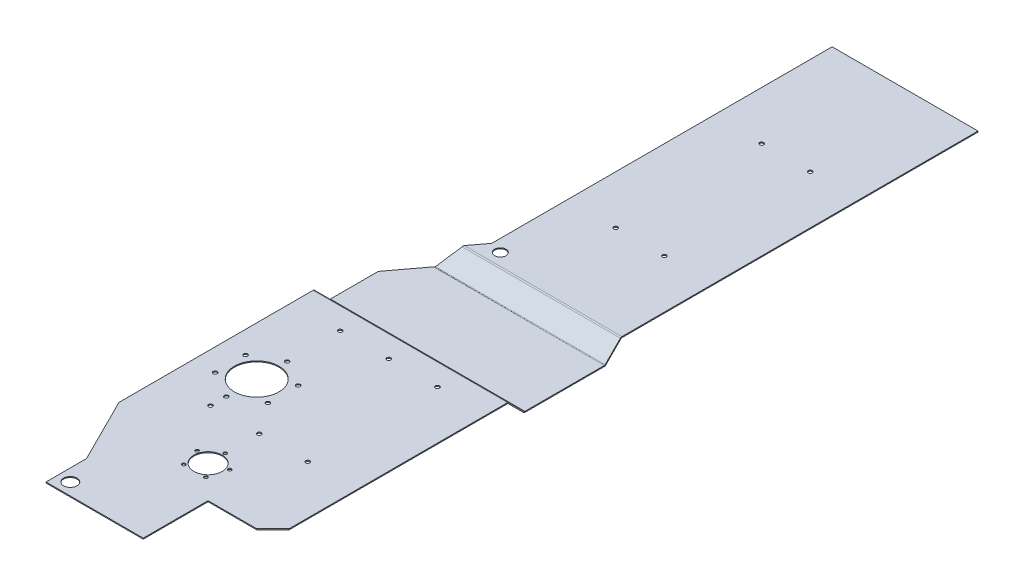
ISO-10303-21;
HEADER;
FILE_DESCRIPTION(('STEP AP214'),'2;1');
FILE_NAME('part.step','',(''),(''),'','','');
FILE_SCHEMA(('AUTOMOTIVE_DESIGN { 1 0 10303 214 1 1 1 1 }'));
ENDSEC;
DATA;
#1=APPLICATION_CONTEXT('core data for automotive mechanical design processes');
#2=APPLICATION_PROTOCOL_DEFINITION('international standard','automotive_design',2000,#1);
#3=PRODUCT_CONTEXT('',#1,'mechanical');
#4=PRODUCT('Part','Part','',(#3));
#5=PRODUCT_RELATED_PRODUCT_CATEGORY('part','',(#4));
#6=PRODUCT_DEFINITION_FORMATION('','',#4);
#7=PRODUCT_DEFINITION_CONTEXT('part definition',#1,'design');
#8=PRODUCT_DEFINITION('design','',#6,#7);
#9=PRODUCT_DEFINITION_SHAPE('','',#8);
#10=(LENGTH_UNIT() NAMED_UNIT(*) SI_UNIT(.MILLI.,.METRE.));
#11=(NAMED_UNIT(*) PLANE_ANGLE_UNIT() SI_UNIT($,.RADIAN.));
#12=(NAMED_UNIT(*) SI_UNIT($,.STERADIAN.) SOLID_ANGLE_UNIT());
#13=UNCERTAINTY_MEASURE_WITH_UNIT(LENGTH_MEASURE(1.E-05),#10,'distance_accuracy_value','');
#14=(GEOMETRIC_REPRESENTATION_CONTEXT(3) GLOBAL_UNCERTAINTY_ASSIGNED_CONTEXT((#13)) GLOBAL_UNIT_ASSIGNED_CONTEXT((#10,
#11,#12)) REPRESENTATION_CONTEXT('',''));
#15=CARTESIAN_POINT('',(0.,0.,0.));
#16=DIRECTION('',(0.,0.,1.));
#17=DIRECTION('',(1.,0.,0.));
#18=AXIS2_PLACEMENT_3D('',#15,#16,#17);
#19=CARTESIAN_POINT('',(0.,171.45,908.049999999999));
#20=DIRECTION('',(1.,0.,0.));
#21=DIRECTION('',(0.,0.707106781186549,0.707106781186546));
#22=AXIS2_PLACEMENT_3D('',#19,#20,#21);
#23=PLANE('',#22);
#24=DIRECTION('',(0.,0.707106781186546,-0.707106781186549));
#25=VECTOR('',#24,1.);
#26=CARTESIAN_POINT('',(0.,-0.491006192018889,736.108993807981));
#27=LINE('',#26,#25);
#28=CARTESIAN_POINT('',(0.,-0.491006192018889,736.108993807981));
#29=VERTEX_POINT('',#28);
#30=CARTESIAN_POINT('',(0.,0.586624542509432,735.031363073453));
#31=VERTEX_POINT('',#30);
#32=EDGE_CURVE('E11',#29,#31,#27,.T.);
#33=ORIENTED_EDGE('',*,*,#32,.F.);
#34=DIRECTION('',(0.,0.707106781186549,0.707106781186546));
#35=VECTOR('',#34,1.);
#36=CARTESIAN_POINT('',(0.,171.45,908.049999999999));
#37=LINE('',#36,#35);
#38=CARTESIAN_POINT('',(0.,-24.4626245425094,712.13737545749));
#39=VERTEX_POINT('',#38);
#40=EDGE_CURVE('E238',#39,#29,#37,.T.);
#41=ORIENTED_EDGE('',*,*,#40,.F.);
#42=DIRECTION('',(0.,0.707106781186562,-0.707106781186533));
#43=VECTOR('',#42,1.);
#44=CARTESIAN_POINT('',(0.,-24.4626245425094,712.13737545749));
#45=LINE('',#44,#43);
#46=CARTESIAN_POINT('',(1.11022302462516E-13,-23.3849938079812,711.059744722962));
#47=VERTEX_POINT('',#46);
#48=EDGE_CURVE('E49',#39,#47,#45,.T.);
#49=ORIENTED_EDGE('',*,*,#48,.T.);
#50=DIRECTION('',(0.,-0.707106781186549,-0.707106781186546));
#51=VECTOR('',#50,1.);
#52=CARTESIAN_POINT('',(1.11022302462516E-13,33.0415730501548,767.486311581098));
#53=LINE('',#52,#51);
#54=EDGE_CURVE('E490',#47,#31,#53,.F.);
#55=ORIENTED_EDGE('',*,*,#54,.T.);
#56=EDGE_LOOP('',(#33,#41,#49,#55));
#57=FACE_BOUND('',#56,.T.);
#58=ADVANCED_FACE('F39',(#57),#23,.T.);
#59=CARTESIAN_POINT('',(0.,-22.1996,709.874350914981));
#60=DIRECTION('',(1.,0.,0.));
#61=DIRECTION('',(0.,0.,-1.));
#62=AXIS2_PLACEMENT_3D('',#59,#60,#61);
#63=PLANE('',#62);
#64=ORIENTED_EDGE('',*,*,#48,.F.);
#65=CARTESIAN_POINT('',(0.,-22.1996,709.874350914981));
#66=DIRECTION('',(-1.,0.,0.));
#67=DIRECTION('',(0.,0.,1.));
#68=AXIS2_PLACEMENT_3D('',#65,#66,#67);
#69=CIRCLE('',#68,3.2004);
#70=CARTESIAN_POINT('',(0.,-25.4,709.874350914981));
#71=VERTEX_POINT('',#70);
#72=EDGE_CURVE('E308',#39,#71,#69,.F.);
#73=ORIENTED_EDGE('',*,*,#72,.T.);
#74=DIRECTION('',(0.,1.,0.));
#75=VECTOR('',#74,1.);
#76=CARTESIAN_POINT('',(0.,-25.4,709.874350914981));
#77=LINE('',#76,#75);
#78=CARTESIAN_POINT('',(0.,-23.876,709.874350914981));
#79=VERTEX_POINT('',#78);
#80=EDGE_CURVE('E382',#71,#79,#77,.T.);
#81=ORIENTED_EDGE('',*,*,#80,.T.);
#82=CARTESIAN_POINT('',(0.,-22.1996,709.874350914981));
#83=DIRECTION('',(-1.,0.,0.));
#84=DIRECTION('',(0.,0.,1.));
#85=AXIS2_PLACEMENT_3D('',#82,#83,#84);
#86=CIRCLE('',#85,1.6764);
#87=EDGE_CURVE('E546',#47,#79,#86,.F.);
#88=ORIENTED_EDGE('',*,*,#87,.F.);
#89=EDGE_LOOP('',(#64,#73,#81,#88));
#90=FACE_BOUND('',#89,.T.);
#91=ADVANCED_FACE('F654',(#90),#63,.T.);
#92=CARTESIAN_POINT('',(0.,-25.3999999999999,1079.5));
#93=DIRECTION('',(1.,0.,0.));
#94=DIRECTION('',(0.,0.,1.));
#95=AXIS2_PLACEMENT_3D('',#92,#93,#94);
#96=PLANE('',#95);
#97=ORIENTED_EDGE('',*,*,#80,.F.);
#98=DIRECTION('',(0.,0.,1.));
#99=VECTOR('',#98,1.);
#100=CARTESIAN_POINT('',(0.,-25.3999999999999,1079.5));
#101=LINE('',#100,#99);
#102=CARTESIAN_POINT('',(0.,-25.4,585.525649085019));
#103=VERTEX_POINT('',#102);
#104=EDGE_CURVE('E232',#103,#71,#101,.T.);
#105=ORIENTED_EDGE('',*,*,#104,.F.);
#106=DIRECTION('',(0.,1.,0.));
#107=VECTOR('',#106,1.);
#108=CARTESIAN_POINT('',(0.,-25.4,585.525649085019));
#109=LINE('',#108,#107);
#110=CARTESIAN_POINT('',(-1.11022302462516E-13,-23.876,585.525649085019));
#111=VERTEX_POINT('',#110);
#112=EDGE_CURVE('E380',#103,#111,#109,.T.);
#113=ORIENTED_EDGE('',*,*,#112,.T.);
#114=DIRECTION('',(0.,0.,-1.));
#115=VECTOR('',#114,1.);
#116=CARTESIAN_POINT('',(-1.11022302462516E-13,-23.876,711.2));
#117=LINE('',#116,#115);
#118=EDGE_CURVE('E542',#111,#79,#117,.F.);
#119=ORIENTED_EDGE('',*,*,#118,.T.);
#120=EDGE_LOOP('',(#97,#105,#113,#119));
#121=FACE_BOUND('',#120,.T.);
#122=ADVANCED_FACE('F646',(#121),#96,.T.);
#123=CARTESIAN_POINT('',(0.,-22.1996,585.525649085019));
#124=DIRECTION('',(1.,0.,0.));
#125=DIRECTION('',(0.,0.,-1.));
#126=AXIS2_PLACEMENT_3D('',#123,#124,#125);
#127=PLANE('',#126);
#128=ORIENTED_EDGE('',*,*,#112,.F.);
#129=CARTESIAN_POINT('',(0.,-22.1996,585.525649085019));
#130=DIRECTION('',(-1.,0.,0.));
#131=DIRECTION('',(0.,0.,1.));
#132=AXIS2_PLACEMENT_3D('',#129,#130,#131);
#133=CIRCLE('',#132,3.2004);
#134=CARTESIAN_POINT('',(0.,-24.4626245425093,583.262624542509));
#135=VERTEX_POINT('',#134);
#136=EDGE_CURVE('E319',#103,#135,#133,.F.);
#137=ORIENTED_EDGE('',*,*,#136,.T.);
#138=DIRECTION('',(0.,0.707106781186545,0.70710678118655));
#139=VECTOR('',#138,1.);
#140=CARTESIAN_POINT('',(0.,-24.4626245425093,583.262624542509));
#141=LINE('',#140,#139);
#142=CARTESIAN_POINT('',(0.,-23.3849938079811,584.340255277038));
#143=VERTEX_POINT('',#142);
#144=EDGE_CURVE('E378',#135,#143,#141,.T.);
#145=ORIENTED_EDGE('',*,*,#144,.T.);
#146=CARTESIAN_POINT('',(0.,-22.1996,585.525649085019));
#147=DIRECTION('',(-1.,0.,0.));
#148=DIRECTION('',(0.,0.,1.));
#149=AXIS2_PLACEMENT_3D('',#146,#147,#148);
#150=CIRCLE('',#149,1.6764);
#151=EDGE_CURVE('E557',#111,#143,#150,.F.);
#152=ORIENTED_EDGE('',*,*,#151,.F.);
#153=EDGE_LOOP('',(#128,#137,#145,#152));
#154=FACE_BOUND('',#153,.T.);
#155=ADVANCED_FACE('F639',(#154),#127,.T.);
#156=CARTESIAN_POINT('',(0.,-260.35,819.149999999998));
#157=DIRECTION('',(1.,0.,0.));
#158=DIRECTION('',(0.,-0.70710678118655,0.707106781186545));
#159=AXIS2_PLACEMENT_3D('',#156,#157,#158);
#160=PLANE('',#159);
#161=ORIENTED_EDGE('',*,*,#144,.F.);
#162=DIRECTION('',(0.,-0.70710678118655,0.707106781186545));
#163=VECTOR('',#162,1.);
#164=CARTESIAN_POINT('',(0.,-260.35,819.149999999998));
#165=LINE('',#164,#163);
#166=CARTESIAN_POINT('',(0.,-0.491006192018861,559.291006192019));
#167=VERTEX_POINT('',#166);
#168=EDGE_CURVE('E600',#167,#135,#165,.T.);
#169=ORIENTED_EDGE('',*,*,#168,.F.);
#170=DIRECTION('',(0.,0.707106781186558,0.707106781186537));
#171=VECTOR('',#170,1.);
#172=CARTESIAN_POINT('',(0.,-0.491006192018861,559.291006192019));
#173=LINE('',#172,#171);
#174=CARTESIAN_POINT('',(0.,0.58662454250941,560.368636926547));
#175=VERTEX_POINT('',#174);
#176=EDGE_CURVE('E376',#167,#175,#173,.T.);
#177=ORIENTED_EDGE('',*,*,#176,.T.);
#178=DIRECTION('',(0.,0.70710678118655,-0.707106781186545));
#179=VECTOR('',#178,1.);
#180=CARTESIAN_POINT('',(0.,-24.3223692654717,585.277630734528));
#181=LINE('',#180,#179);
#182=EDGE_CURVE('E560',#175,#143,#181,.F.);
#183=ORIENTED_EDGE('',*,*,#182,.T.);
#184=EDGE_LOOP('',(#161,#169,#177,#183));
#185=FACE_BOUND('',#184,.T.);
#186=ADVANCED_FACE('F631',(#185),#160,.T.);
#187=CARTESIAN_POINT('',(0.,-1.6764,558.105612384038));
#188=DIRECTION('',(1.,0.,0.));
#189=DIRECTION('',(0.,0.,-1.));
#190=AXIS2_PLACEMENT_3D('',#187,#188,#189);
#191=PLANE('',#190);
#192=ORIENTED_EDGE('',*,*,#176,.F.);
#193=CARTESIAN_POINT('',(0.,-1.6764,558.105612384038));
#194=DIRECTION('',(-1.,0.,0.));
#195=DIRECTION('',(0.,0.,1.));
#196=AXIS2_PLACEMENT_3D('',#193,#194,#195);
#197=CIRCLE('',#196,1.6764);
#198=CARTESIAN_POINT('',(0.,0.,558.105612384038));
#199=VERTEX_POINT('',#198);
#200=EDGE_CURVE('E216',#167,#199,#197,.T.);
#201=ORIENTED_EDGE('',*,*,#200,.T.);
#202=DIRECTION('',(0.,1.,0.));
#203=VECTOR('',#202,1.);
#204=CARTESIAN_POINT('',(0.,0.,558.105612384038));
#205=LINE('',#204,#203);
#206=CARTESIAN_POINT('',(0.,1.524,558.105612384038));
#207=VERTEX_POINT('',#206);
#208=EDGE_CURVE('E181',#199,#207,#205,.T.);
#209=ORIENTED_EDGE('',*,*,#208,.T.);
#210=CARTESIAN_POINT('',(0.,-1.6764,558.105612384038));
#211=DIRECTION('',(1.,0.,0.));
#212=DIRECTION('',(0.,0.,-1.));
#213=AXIS2_PLACEMENT_3D('',#210,#211,#212);
#214=CIRCLE('',#213,3.2004);
#215=EDGE_CURVE('E562',#175,#207,#214,.F.);
#216=ORIENTED_EDGE('',*,*,#215,.F.);
#217=EDGE_LOOP('',(#192,#201,#209,#216));
#218=FACE_BOUND('',#217,.T.);
#219=ADVANCED_FACE('F628',(#218),#191,.T.);
#220=CARTESIAN_POINT('',(0.,0.,1079.5));
#221=DIRECTION('',(1.,0.,0.));
#222=DIRECTION('',(0.,0.,-1.));
#223=AXIS2_PLACEMENT_3D('',#220,#221,#222);
#224=PLANE('',#223);
#225=ORIENTED_EDGE('',*,*,#208,.F.);
#226=DIRECTION('',(0.,0.,-1.));
#227=VECTOR('',#226,1.);
#228=CARTESIAN_POINT('',(0.,0.,1079.5));
#229=LINE('',#228,#227);
#230=CARTESIAN_POINT('',(0.,0.,0.));
#231=VERTEX_POINT('',#230);
#232=EDGE_CURVE('E206',#199,#231,#229,.T.);
#233=ORIENTED_EDGE('',*,*,#232,.T.);
#234=DIRECTION('',(0.,1.,0.));
#235=VECTOR('',#234,1.);
#236=CARTESIAN_POINT('',(0.,0.,0.));
#237=LINE('',#236,#235);
#238=CARTESIAN_POINT('',(0.,1.524,0.));
#239=VERTEX_POINT('',#238);
#240=EDGE_CURVE('E373',#231,#239,#237,.T.);
#241=ORIENTED_EDGE('',*,*,#240,.T.);
#242=DIRECTION('',(0.,0.,1.));
#243=VECTOR('',#242,1.);
#244=CARTESIAN_POINT('',(0.,1.524,0.));
#245=LINE('',#244,#243);
#246=EDGE_CURVE('E570',#207,#239,#245,.F.);
#247=ORIENTED_EDGE('',*,*,#246,.F.);
#248=EDGE_LOOP('',(#225,#233,#241,#247));
#249=FACE_BOUND('',#248,.T.);
#250=ADVANCED_FACE('F619',(#249),#224,.T.);
#251=CARTESIAN_POINT('',(0.,0.,0.));
#252=DIRECTION('',(0.,0.,-1.));
#253=DIRECTION('',(-1.,0.,0.));
#254=AXIS2_PLACEMENT_3D('',#251,#252,#253);
#255=PLANE('',#254);
#256=ORIENTED_EDGE('',*,*,#240,.F.);
#257=DIRECTION('',(-1.,0.,0.));
#258=VECTOR('',#257,1.);
#259=CARTESIAN_POINT('',(0.,0.,0.));
#260=LINE('',#259,#258);
#261=CARTESIAN_POINT('',(-228.6,0.,0.));
#262=VERTEX_POINT('',#261);
#263=EDGE_CURVE('E226',#231,#262,#260,.T.);
#264=ORIENTED_EDGE('',*,*,#263,.T.);
#265=DIRECTION('',(0.,1.,0.));
#266=VECTOR('',#265,1.);
#267=CARTESIAN_POINT('',(-228.6,0.,0.));
#268=LINE('',#267,#266);
#269=CARTESIAN_POINT('',(-228.6,1.524,0.));
#270=VERTEX_POINT('',#269);
#271=EDGE_CURVE('E371',#262,#270,#268,.T.);
#272=ORIENTED_EDGE('',*,*,#271,.T.);
#273=DIRECTION('',(1.,0.,0.));
#274=VECTOR('',#273,1.);
#275=CARTESIAN_POINT('',(0.,1.524,0.));
#276=LINE('',#275,#274);
#277=EDGE_CURVE('E567',#239,#270,#276,.F.);
#278=ORIENTED_EDGE('',*,*,#277,.F.);
#279=EDGE_LOOP('',(#256,#264,#272,#278));
#280=FACE_BOUND('',#279,.T.);
#281=ADVANCED_FACE('F617',(#280),#255,.T.);
#282=CARTESIAN_POINT('',(-228.6,0.,0.));
#283=DIRECTION('',(-1.,0.,0.));
#284=DIRECTION('',(0.,0.,1.));
#285=AXIS2_PLACEMENT_3D('',#282,#283,#284);
#286=PLANE('',#285);
#287=ORIENTED_EDGE('',*,*,#271,.F.);
#288=DIRECTION('',(0.,0.,1.));
#289=VECTOR('',#288,1.);
#290=CARTESIAN_POINT('',(-228.6,0.,0.));
#291=LINE('',#290,#289);
#292=CARTESIAN_POINT('',(-228.6,0.,533.4));
#293=VERTEX_POINT('',#292);
#294=EDGE_CURVE('E221',#262,#293,#291,.T.);
#295=ORIENTED_EDGE('',*,*,#294,.T.);
#296=DIRECTION('',(0.,1.,0.));
#297=VECTOR('',#296,1.);
#298=CARTESIAN_POINT('',(-228.6,0.,533.4));
#299=LINE('',#298,#297);
#300=CARTESIAN_POINT('',(-228.6,1.524,533.4));
#301=VERTEX_POINT('',#300);
#302=EDGE_CURVE('E194',#293,#301,#299,.T.);
#303=ORIENTED_EDGE('',*,*,#302,.T.);
#304=DIRECTION('',(0.,0.,1.));
#305=VECTOR('',#304,1.);
#306=CARTESIAN_POINT('',(-228.6,1.524,0.));
#307=LINE('',#306,#305);
#308=EDGE_CURVE('E564',#270,#301,#307,.T.);
#309=ORIENTED_EDGE('',*,*,#308,.F.);
#310=EDGE_LOOP('',(#287,#295,#303,#309));
#311=FACE_BOUND('',#310,.T.);
#312=ADVANCED_FACE('F1377',(#311),#286,.T.);
#313=CARTESIAN_POINT('',(-228.6,0.,533.4));
#314=DIRECTION('',(-0.8,0.,-0.6));
#315=DIRECTION('',(-0.6,0.,0.8));
#316=AXIS2_PLACEMENT_3D('',#313,#314,#315);
#317=PLANE('',#316);
#318=ORIENTED_EDGE('',*,*,#302,.F.);
#319=DIRECTION('',(-0.6,0.,0.8));
#320=VECTOR('',#319,1.);
#321=CARTESIAN_POINT('',(-228.6,0.,533.4));
#322=LINE('',#321,#320);
#323=CARTESIAN_POINT('',(-247.129209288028,0.,558.105612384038));
#324=VERTEX_POINT('',#323);
#325=EDGE_CURVE('E203',#293,#324,#322,.T.);
#326=ORIENTED_EDGE('',*,*,#325,.T.);
#327=DIRECTION('',(0.,1.,0.));
#328=VECTOR('',#327,1.);
#329=CARTESIAN_POINT('',(-247.129209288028,0.,558.105612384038));
#330=LINE('',#329,#328);
#331=CARTESIAN_POINT('',(-247.129209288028,1.524,558.105612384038));
#332=VERTEX_POINT('',#331);
#333=EDGE_CURVE('E58',#324,#332,#330,.T.);
#334=ORIENTED_EDGE('',*,*,#333,.T.);
#335=DIRECTION('',(-0.6,0.,0.8));
#336=VECTOR('',#335,1.);
#337=CARTESIAN_POINT('',(-228.6,1.524,533.4));
#338=LINE('',#337,#336);
#339=EDGE_CURVE('E553',#301,#332,#338,.T.);
#340=ORIENTED_EDGE('',*,*,#339,.F.);
#341=EDGE_LOOP('',(#318,#326,#334,#340));
#342=FACE_BOUND('',#341,.T.);
#343=ADVANCED_FACE('F219',(#342),#317,.T.);
#344=CARTESIAN_POINT('',(-245.871909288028,-1.6764,556.429212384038));
#345=CARTESIAN_POINT('',(-245.871909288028,-1.6764,555.921212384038));
#346=CARTESIAN_POINT('',(-245.871909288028,-1.6764,555.413212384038));
#347=CARTESIAN_POINT('',(-245.871909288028,-1.6764,554.905212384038));
#348=CARTESIAN_POINT('',(-245.871909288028,1.6764,556.429212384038));
#349=CARTESIAN_POINT('',(-245.871909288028,2.6924,555.921212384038));
#350=CARTESIAN_POINT('',(-245.871909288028,3.7084,555.413212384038));
#351=CARTESIAN_POINT('',(-245.871909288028,4.7244,554.905212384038));
#352=CARTESIAN_POINT('',(-248.386509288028,1.6764,559.782012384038));
#353=CARTESIAN_POINT('',(-248.386509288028,2.6924,560.290012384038));
#354=CARTESIAN_POINT('',(-248.386509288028,3.7084,560.798012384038));
#355=CARTESIAN_POINT('',(-248.386509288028,4.7244,561.306012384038));
#356=CARTESIAN_POINT('',(-248.386509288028,-1.6764,559.782012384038));
#357=CARTESIAN_POINT('',(-248.386509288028,-1.6764,560.290012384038));
#358=CARTESIAN_POINT('',(-248.386509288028,-1.6764,560.798012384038));
#359=CARTESIAN_POINT('',(-248.386509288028,-1.6764,561.306012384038));
#360=CARTESIAN_POINT('',(-248.386509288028,-5.0292,559.782012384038));
#361=CARTESIAN_POINT('',(-248.386509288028,-6.0452,560.290012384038));
#362=CARTESIAN_POINT('',(-248.386509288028,-7.0612,560.798012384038));
#363=CARTESIAN_POINT('',(-248.386509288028,-8.0772,561.306012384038));
#364=CARTESIAN_POINT('',(-245.871909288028,-5.0292,556.429212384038));
#365=CARTESIAN_POINT('',(-245.871909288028,-6.0452,555.921212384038));
#366=CARTESIAN_POINT('',(-245.871909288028,-7.0612,555.413212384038));
#367=CARTESIAN_POINT('',(-245.871909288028,-8.0772,554.905212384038));
#368=CARTESIAN_POINT('',(-245.871909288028,-1.6764,556.429212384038));
#369=CARTESIAN_POINT('',(-245.871909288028,-1.6764,555.921212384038));
#370=CARTESIAN_POINT('',(-245.871909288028,-1.6764,555.413212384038));
#371=CARTESIAN_POINT('',(-245.871909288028,-1.6764,554.905212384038));
#372=(BOUNDED_SURFACE() B_SPLINE_SURFACE(3,3,((#344,#345,#346,#347),(#348,#349,#350,#351),(#352,
#353,#354,#355),(#356,#357,#358,#359),(#360,#361,#362,#363),(#364,#365,#366,#367),(#368,#369,
#370,#371)),.UNSPECIFIED.,.T.,.F.,.F.) B_SPLINE_SURFACE_WITH_KNOTS((4,3,4),(4,4),(0.,0.5,1.),
(0.,1.),.UNSPECIFIED.) GEOMETRIC_REPRESENTATION_ITEM() RATIONAL_B_SPLINE_SURFACE(((1.,1.,1.,1.),
(0.333333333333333,0.333333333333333,0.333333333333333,0.333333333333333),(0.333333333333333,
0.333333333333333,0.333333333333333,0.333333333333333),(1.,1.,1.,1.),(0.333333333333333,
0.333333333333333,0.333333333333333,0.333333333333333),(0.333333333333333,0.333333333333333,
0.333333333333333,0.333333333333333),(1.,1.,1.,1.))) REPRESENTATION_ITEM('') SURFACE());
#373=CARTESIAN_POINT('',(-247.129209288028,-1.6764,558.105612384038));
#374=DIRECTION('',(0.8,0.,0.6));
#375=DIRECTION('',(0.6,0.,-0.8));
#376=AXIS2_PLACEMENT_3D('',#373,#374,#375);
#377=ELLIPSE('',#376,2.0955,1.6764);
#378=CARTESIAN_POINT('',(-248.018254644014,-0.491006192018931,559.291006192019));
#379=VERTEX_POINT('',#378);
#380=EDGE_CURVE('E190',#324,#379,#377,.T.);
#381=DIRECTION('',(0.,0.707106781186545,0.70710678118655));
#382=VECTOR('',#381,1.);
#383=CARTESIAN_POINT('',(-248.018254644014,-0.491006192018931,559.291006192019));
#384=LINE('',#383,#382);
#385=CARTESIAN_POINT('',(-248.018254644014,0.586624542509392,560.368636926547));
#386=VERTEX_POINT('',#385);
#387=EDGE_CURVE('E195',#379,#386,#384,.T.);
#388=CARTESIAN_POINT('',(-247.129209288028,-1.6764,558.105612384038));
#389=DIRECTION('',(0.930751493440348,0.,0.365652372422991));
#390=DIRECTION('',(0.365652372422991,0.,-0.930751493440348));
#391=AXIS2_PLACEMENT_3D('',#388,#389,#390);
#392=ELLIPSE('',#391,3.43851180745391,3.2004);
#393=EDGE_CURVE('E192',#332,#386,#392,.T.);
#394=ORIENTED_EDGE('',*,*,#333,.F.);
#395=ORIENTED_EDGE('',*,*,#380,.T.);
#396=ORIENTED_EDGE('',*,*,#387,.T.);
#397=ORIENTED_EDGE('',*,*,#393,.F.);
#398=EDGE_LOOP('',(#394,#395,#396,#397));
#399=FACE_BOUND('',#398,.T.);
#400=ADVANCED_FACE('F187',(#399),#372,.T.);
#401=CARTESIAN_POINT('',(-236.034146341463,15.4878048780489,543.312195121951));
#402=DIRECTION('',(-0.883452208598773,0.33129457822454,-0.331294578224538));
#403=DIRECTION('',(0.468521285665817,0.624695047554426,-0.624695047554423));
#404=AXIS2_PLACEMENT_3D('',#401,#402,#403);
#405=PLANE('',#404);
#406=ORIENTED_EDGE('',*,*,#387,.F.);
#407=DIRECTION('',(0.468521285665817,0.624695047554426,-0.624695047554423));
#408=VECTOR('',#407,1.);
#409=CARTESIAN_POINT('',(-236.034146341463,15.4878048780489,543.312195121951));
#410=LINE('',#409,#408);
#411=CARTESIAN_POINT('',(-265.996968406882,-24.4626245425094,583.262624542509));
#412=VERTEX_POINT('',#411);
#413=EDGE_CURVE('E301',#412,#379,#410,.T.);
#414=ORIENTED_EDGE('',*,*,#413,.F.);
#415=DIRECTION('',(0.,0.707106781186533,0.707106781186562));
#416=VECTOR('',#415,1.);
#417=CARTESIAN_POINT('',(-265.996968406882,-24.4626245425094,583.262624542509));
#418=LINE('',#417,#416);
#419=CARTESIAN_POINT('',(-265.996968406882,-23.3849938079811,584.340255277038));
#420=VERTEX_POINT('',#419);
#421=EDGE_CURVE('E366',#412,#420,#418,.T.);
#422=ORIENTED_EDGE('',*,*,#421,.T.);
#423=DIRECTION('',(0.468521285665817,0.624695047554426,-0.624695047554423));
#424=VECTOR('',#423,1.);
#425=CARTESIAN_POINT('',(-236.034146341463,16.5654356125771,544.38982585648));
#426=LINE('',#425,#424);
#427=EDGE_CURVE('E537',#420,#386,#426,.T.);
#428=ORIENTED_EDGE('',*,*,#427,.T.);
#429=EDGE_LOOP('',(#406,#414,#422,#428));
#430=FACE_BOUND('',#429,.T.);
#431=ADVANCED_FACE('F719',(#430),#405,.T.);
#432=CARTESIAN_POINT('',(-270.094536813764,-22.1996,588.726049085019));
#433=CARTESIAN_POINT('',(-270.094536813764,-22.1996,588.218049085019));
#434=CARTESIAN_POINT('',(-270.094536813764,-22.1996,587.710049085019));
#435=CARTESIAN_POINT('',(-270.094536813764,-22.1996,587.202049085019));
#436=CARTESIAN_POINT('',(-270.094536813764,-15.7988,588.726049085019));
#437=CARTESIAN_POINT('',(-270.094536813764,-16.8148,588.218049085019));
#438=CARTESIAN_POINT('',(-270.094536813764,-17.8308,587.710049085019));
#439=CARTESIAN_POINT('',(-270.094536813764,-18.8468,587.202049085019));
#440=CARTESIAN_POINT('',(-265.293936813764,-15.7988,582.325249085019));
#441=CARTESIAN_POINT('',(-265.293936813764,-16.8148,582.833249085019));
#442=CARTESIAN_POINT('',(-265.293936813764,-17.8308,583.341249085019));
#443=CARTESIAN_POINT('',(-265.293936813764,-18.8468,583.849249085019));
#444=CARTESIAN_POINT('',(-265.293936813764,-22.1996,582.325249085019));
#445=CARTESIAN_POINT('',(-265.293936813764,-22.1996,582.833249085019));
#446=CARTESIAN_POINT('',(-265.293936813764,-22.1996,583.341249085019));
#447=CARTESIAN_POINT('',(-265.293936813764,-22.1996,583.849249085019));
#448=CARTESIAN_POINT('',(-265.293936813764,-28.6004,582.325249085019));
#449=CARTESIAN_POINT('',(-265.293936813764,-27.5844,582.833249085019));
#450=CARTESIAN_POINT('',(-265.293936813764,-26.5684,583.341249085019));
#451=CARTESIAN_POINT('',(-265.293936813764,-25.5524,583.849249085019));
#452=CARTESIAN_POINT('',(-270.094536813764,-28.6004,588.726049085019));
#453=CARTESIAN_POINT('',(-270.094536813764,-27.5844,588.218049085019));
#454=CARTESIAN_POINT('',(-270.094536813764,-26.5684,587.710049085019));
#455=CARTESIAN_POINT('',(-270.094536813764,-25.5524,587.202049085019));
#456=CARTESIAN_POINT('',(-270.094536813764,-22.1996,588.726049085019));
#457=CARTESIAN_POINT('',(-270.094536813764,-22.1996,588.218049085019));
#458=CARTESIAN_POINT('',(-270.094536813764,-22.1996,587.710049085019));
#459=CARTESIAN_POINT('',(-270.094536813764,-22.1996,587.202049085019));
#460=(BOUNDED_SURFACE() B_SPLINE_SURFACE(3,3,((#432,#433,#434,#435),(#436,#437,#438,#439),(#440,
#441,#442,#443),(#444,#445,#446,#447),(#448,#449,#450,#451),(#452,#453,#454,#455),(#456,#457,
#458,#459)),.UNSPECIFIED.,.T.,.F.,.F.) B_SPLINE_SURFACE_WITH_KNOTS((4,3,4),(4,4),(0.,0.5,1.),
(0.,1.),.UNSPECIFIED.) GEOMETRIC_REPRESENTATION_ITEM() RATIONAL_B_SPLINE_SURFACE(((1.,1.,1.,1.),
(0.333333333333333,0.333333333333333,0.333333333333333,0.333333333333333),(0.333333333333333,
0.333333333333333,0.333333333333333,0.333333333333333),(1.,1.,1.,1.),(0.333333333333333,
0.333333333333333,0.333333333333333,0.333333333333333),(0.333333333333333,0.333333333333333,
0.333333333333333,0.333333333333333),(1.,1.,1.,1.))) REPRESENTATION_ITEM('') SURFACE());
#461=CARTESIAN_POINT('',(-267.694236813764,-22.1996,585.525649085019));
#462=DIRECTION('',(0.8,0.,0.6));
#463=DIRECTION('',(-0.6,0.,0.8));
#464=AXIS2_PLACEMENT_3D('',#461,#462,#463);
#465=ELLIPSE('',#464,4.0005,3.2004);
#466=CARTESIAN_POINT('',(-267.694236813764,-25.4,585.525649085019));
#467=VERTEX_POINT('',#466);
#468=EDGE_CURVE('E311',#412,#467,#465,.F.);
#469=DIRECTION('',(0.,1.,0.));
#470=VECTOR('',#469,1.);
#471=CARTESIAN_POINT('',(-267.694236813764,-25.4,585.525649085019));
#472=LINE('',#471,#470);
#473=CARTESIAN_POINT('',(-267.694236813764,-23.876,585.525649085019));
#474=VERTEX_POINT('',#473);
#475=EDGE_CURVE('E363',#467,#474,#472,.T.);
#476=CARTESIAN_POINT('',(-267.694236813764,-22.1996,585.525649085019));
#477=DIRECTION('',(0.572588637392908,0.,0.81984282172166));
#478=DIRECTION('',(-0.81984282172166,0.,0.572588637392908));
#479=AXIS2_PLACEMENT_3D('',#476,#477,#478);
#480=ELLIPSE('',#479,2.927756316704,1.6764);
#481=EDGE_CURVE('E554',#420,#474,#480,.F.);
#482=ORIENTED_EDGE('',*,*,#421,.F.);
#483=ORIENTED_EDGE('',*,*,#468,.T.);
#484=ORIENTED_EDGE('',*,*,#475,.T.);
#485=ORIENTED_EDGE('',*,*,#481,.F.);
#486=EDGE_LOOP('',(#482,#483,#484,#485));
#487=FACE_BOUND('',#486,.T.);
#488=ADVANCED_FACE('F725',(#487),#460,.T.);
#489=CARTESIAN_POINT('',(-228.6,-25.4,533.4));
#490=DIRECTION('',(-0.8,0.,-0.6));
#491=DIRECTION('',(0.6,0.,-0.8));
#492=AXIS2_PLACEMENT_3D('',#489,#490,#491);
#493=PLANE('',#492);
#494=ORIENTED_EDGE('',*,*,#475,.F.);
#495=DIRECTION('',(0.6,0.,-0.8));
#496=VECTOR('',#495,1.);
#497=CARTESIAN_POINT('',(-228.6,-25.4,533.4));
#498=LINE('',#497,#496);
#499=CARTESIAN_POINT('',(-304.8,-25.4,635.));
#500=VERTEX_POINT('',#499);
#501=EDGE_CURVE('E220',#500,#467,#498,.T.);
#502=ORIENTED_EDGE('',*,*,#501,.F.);
#503=DIRECTION('',(0.,1.,0.));
#504=VECTOR('',#503,1.);
#505=CARTESIAN_POINT('',(-304.8,-25.4,635.));
#506=LINE('',#505,#504);
#507=CARTESIAN_POINT('',(-304.8,-23.876,635.));
#508=VERTEX_POINT('',#507);
#509=EDGE_CURVE('E360',#500,#508,#506,.T.);
#510=ORIENTED_EDGE('',*,*,#509,.T.);
#511=DIRECTION('',(0.6,0.,-0.8));
#512=VECTOR('',#511,1.);
#513=CARTESIAN_POINT('',(-228.6,-23.876,533.4));
#514=LINE('',#513,#512);
#515=EDGE_CURVE('E550',#508,#474,#514,.T.);
#516=ORIENTED_EDGE('',*,*,#515,.T.);
#517=EDGE_LOOP('',(#494,#502,#510,#516));
#518=FACE_BOUND('',#517,.T.);
#519=ADVANCED_FACE('F1420',(#518),#493,.T.);
#520=CARTESIAN_POINT('',(-304.8,-25.4,711.2));
#521=DIRECTION('',(-1.,0.,0.));
#522=DIRECTION('',(0.,0.,-1.));
#523=AXIS2_PLACEMENT_3D('',#520,#521,#522);
#524=PLANE('',#523);
#525=ORIENTED_EDGE('',*,*,#509,.F.);
#526=DIRECTION('',(0.,0.,-1.));
#527=VECTOR('',#526,1.);
#528=CARTESIAN_POINT('',(-304.8,-25.4,711.2));
#529=LINE('',#528,#527);
#530=CARTESIAN_POINT('',(-304.8,-25.4,709.874350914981));
#531=VERTEX_POINT('',#530);
#532=EDGE_CURVE('E224',#531,#500,#529,.T.);
#533=ORIENTED_EDGE('',*,*,#532,.F.);
#534=DIRECTION('',(0.,1.,0.));
#535=VECTOR('',#534,1.);
#536=CARTESIAN_POINT('',(-304.8,-25.4,709.874350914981));
#537=LINE('',#536,#535);
#538=CARTESIAN_POINT('',(-304.8,-23.876,709.874350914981));
#539=VERTEX_POINT('',#538);
#540=EDGE_CURVE('E357',#531,#539,#537,.T.);
#541=ORIENTED_EDGE('',*,*,#540,.T.);
#542=DIRECTION('',(0.,0.,-1.));
#543=VECTOR('',#542,1.);
#544=CARTESIAN_POINT('',(-304.8,-23.876,711.2));
#545=LINE('',#544,#543);
#546=EDGE_CURVE('E547',#539,#508,#545,.T.);
#547=ORIENTED_EDGE('',*,*,#546,.T.);
#548=EDGE_LOOP('',(#525,#533,#541,#547));
#549=FACE_BOUND('',#548,.T.);
#550=ADVANCED_FACE('F1429',(#549),#524,.T.);
#551=CARTESIAN_POINT('',(-304.8,-22.1996,709.874350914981));
#552=DIRECTION('',(-1.,0.,0.));
#553=DIRECTION('',(0.,0.,1.));
#554=AXIS2_PLACEMENT_3D('',#551,#552,#553);
#555=PLANE('',#554);
#556=ORIENTED_EDGE('',*,*,#540,.F.);
#557=CARTESIAN_POINT('',(-304.8,-22.1996,709.874350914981));
#558=DIRECTION('',(1.,0.,0.));
#559=DIRECTION('',(0.,0.,-1.));
#560=AXIS2_PLACEMENT_3D('',#557,#558,#559);
#561=CIRCLE('',#560,3.2004);
#562=CARTESIAN_POINT('',(-304.8,-24.4626245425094,712.137375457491));
#563=VERTEX_POINT('',#562);
#564=EDGE_CURVE('E298',#531,#563,#561,.F.);
#565=ORIENTED_EDGE('',*,*,#564,.T.);
#566=DIRECTION('',(0.,0.707106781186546,-0.707106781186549));
#567=VECTOR('',#566,1.);
#568=CARTESIAN_POINT('',(-304.8,-24.4626245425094,712.137375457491));
#569=LINE('',#568,#567);
#570=CARTESIAN_POINT('',(-304.8,-23.3849938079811,711.059744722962));
#571=VERTEX_POINT('',#570);
#572=EDGE_CURVE('E354',#563,#571,#569,.T.);
#573=ORIENTED_EDGE('',*,*,#572,.T.);
#574=CARTESIAN_POINT('',(-304.8,-22.1996,709.874350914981));
#575=DIRECTION('',(-1.,0.,0.));
#576=DIRECTION('',(0.,0.,1.));
#577=AXIS2_PLACEMENT_3D('',#574,#575,#576);
#578=CIRCLE('',#577,1.6764);
#579=EDGE_CURVE('E543',#539,#571,#578,.T.);
#580=ORIENTED_EDGE('',*,*,#579,.F.);
#581=EDGE_LOOP('',(#556,#565,#573,#580));
#582=FACE_BOUND('',#581,.T.);
#583=ADVANCED_FACE('F1438',(#582),#555,.T.);
#584=CARTESIAN_POINT('',(-304.8,31.9639423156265,768.563942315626));
#585=DIRECTION('',(-1.,0.,0.));
#586=DIRECTION('',(0.,-0.707106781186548,-0.707106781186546));
#587=AXIS2_PLACEMENT_3D('',#584,#585,#586);
#588=PLANE('',#587);
#589=ORIENTED_EDGE('',*,*,#572,.F.);
#590=DIRECTION('',(0.,-0.707106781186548,-0.707106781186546));
#591=VECTOR('',#590,1.);
#592=CARTESIAN_POINT('',(-304.8,31.9639423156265,768.563942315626));
#593=LINE('',#592,#591);
#594=CARTESIAN_POINT('',(-304.8,-0.491006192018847,736.108993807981));
#595=VERTEX_POINT('',#594);
#596=EDGE_CURVE('E235',#595,#563,#593,.T.);
#597=ORIENTED_EDGE('',*,*,#596,.F.);
#598=DIRECTION('',(0.,0.707106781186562,-0.707106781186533));
#599=VECTOR('',#598,1.);
#600=CARTESIAN_POINT('',(-304.8,-0.491006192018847,736.108993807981));
#601=LINE('',#600,#599);
#602=CARTESIAN_POINT('',(-304.8,0.586624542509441,735.031363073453));
#603=VERTEX_POINT('',#602);
#604=EDGE_CURVE('E351',#595,#603,#601,.T.);
#605=ORIENTED_EDGE('',*,*,#604,.T.);
#606=DIRECTION('',(0.,-0.707106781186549,-0.707106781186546));
#607=VECTOR('',#606,1.);
#608=CARTESIAN_POINT('',(-304.8,33.0415730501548,767.486311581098));
#609=LINE('',#608,#607);
#610=EDGE_CURVE('E539',#603,#571,#609,.T.);
#611=ORIENTED_EDGE('',*,*,#610,.T.);
#612=EDGE_LOOP('',(#589,#597,#605,#611));
#613=FACE_BOUND('',#612,.T.);
#614=ADVANCED_FACE('F1449',(#613),#588,.T.);
#615=CARTESIAN_POINT('',(-304.8,-1.6764,737.294387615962));
#616=DIRECTION('',(-1.,0.,0.));
#617=DIRECTION('',(0.,0.,1.));
#618=AXIS2_PLACEMENT_3D('',#615,#616,#617);
#619=PLANE('',#618);
#620=ORIENTED_EDGE('',*,*,#604,.F.);
#621=CARTESIAN_POINT('',(-304.8,-1.6764,737.294387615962));
#622=DIRECTION('',(1.,0.,0.));
#623=DIRECTION('',(0.,0.,-1.));
#624=AXIS2_PLACEMENT_3D('',#621,#622,#623);
#625=CIRCLE('',#624,1.6764);
#626=CARTESIAN_POINT('',(-304.8,0.,737.294387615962));
#627=VERTEX_POINT('',#626);
#628=EDGE_CURVE('E297',#595,#627,#625,.T.);
#629=ORIENTED_EDGE('',*,*,#628,.T.);
#630=DIRECTION('',(0.,1.,0.));
#631=VECTOR('',#630,1.);
#632=CARTESIAN_POINT('',(-304.8,0.,737.294387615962));
#633=LINE('',#632,#631);
#634=CARTESIAN_POINT('',(-304.8,1.524,737.294387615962));
#635=VERTEX_POINT('',#634);
#636=EDGE_CURVE('E348',#627,#635,#633,.T.);
#637=ORIENTED_EDGE('',*,*,#636,.T.);
#638=CARTESIAN_POINT('',(-304.8,-1.6764,737.294387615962));
#639=DIRECTION('',(-1.,0.,0.));
#640=DIRECTION('',(0.,0.,1.));
#641=AXIS2_PLACEMENT_3D('',#638,#639,#640);
#642=CIRCLE('',#641,3.2004);
#643=EDGE_CURVE('E534',#603,#635,#642,.F.);
#644=ORIENTED_EDGE('',*,*,#643,.F.);
#645=EDGE_LOOP('',(#620,#629,#637,#644));
#646=FACE_BOUND('',#645,.T.);
#647=ADVANCED_FACE('F1459',(#646),#619,.T.);
#648=CARTESIAN_POINT('',(-304.8,0.,635.));
#649=DIRECTION('',(-1.,0.,0.));
#650=DIRECTION('',(0.,0.,1.));
#651=AXIS2_PLACEMENT_3D('',#648,#649,#650);
#652=PLANE('',#651);
#653=ORIENTED_EDGE('',*,*,#636,.F.);
#654=DIRECTION('',(0.,0.,1.));
#655=VECTOR('',#654,1.);
#656=CARTESIAN_POINT('',(-304.8,0.,635.));
#657=LINE('',#656,#655);
#658=CARTESIAN_POINT('',(-304.8,0.,1041.4));
#659=VERTEX_POINT('',#658);
#660=EDGE_CURVE('E275',#627,#659,#657,.T.);
#661=ORIENTED_EDGE('',*,*,#660,.T.);
#662=DIRECTION('',(0.,1.,0.));
#663=VECTOR('',#662,1.);
#664=CARTESIAN_POINT('',(-304.8,0.,1041.4));
#665=LINE('',#664,#663);
#666=CARTESIAN_POINT('',(-304.8,1.524,1041.4));
#667=VERTEX_POINT('',#666);
#668=EDGE_CURVE('E345',#659,#667,#665,.T.);
#669=ORIENTED_EDGE('',*,*,#668,.T.);
#670=DIRECTION('',(0.,0.,1.));
#671=VECTOR('',#670,1.);
#672=CARTESIAN_POINT('',(-304.8,1.524,0.));
#673=LINE('',#672,#671);
#674=EDGE_CURVE('E515',#635,#667,#673,.T.);
#675=ORIENTED_EDGE('',*,*,#674,.F.);
#676=EDGE_LOOP('',(#653,#661,#669,#675));
#677=FACE_BOUND('',#676,.T.);
#678=ADVANCED_FACE('F1469',(#677),#652,.T.);
#679=CARTESIAN_POINT('',(-304.8,0.,1041.4));
#680=DIRECTION('',(-0.894427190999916,0.,0.447213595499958));
#681=DIRECTION('',(0.447213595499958,0.,0.894427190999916));
#682=AXIS2_PLACEMENT_3D('',#679,#680,#681);
#683=PLANE('',#682);
#684=ORIENTED_EDGE('',*,*,#668,.F.);
#685=DIRECTION('',(0.447213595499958,0.,0.894427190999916));
#686=VECTOR('',#685,1.);
#687=CARTESIAN_POINT('',(-304.8,0.,1041.4));
#688=LINE('',#687,#686);
#689=CARTESIAN_POINT('',(-254.,0.,1143.));
#690=VERTEX_POINT('',#689);
#691=EDGE_CURVE('E278',#659,#690,#688,.T.);
#692=ORIENTED_EDGE('',*,*,#691,.T.);
#693=DIRECTION('',(0.,1.,0.));
#694=VECTOR('',#693,1.);
#695=CARTESIAN_POINT('',(-254.,0.,1143.));
#696=LINE('',#695,#694);
#697=CARTESIAN_POINT('',(-254.,1.524,1143.));
#698=VERTEX_POINT('',#697);
#699=EDGE_CURVE('E342',#690,#698,#696,.T.);
#700=ORIENTED_EDGE('',*,*,#699,.T.);
#701=DIRECTION('',(0.447213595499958,0.,0.894427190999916));
#702=VECTOR('',#701,1.);
#703=CARTESIAN_POINT('',(-304.8,1.524,1041.4));
#704=LINE('',#703,#702);
#705=EDGE_CURVE('E529',#667,#698,#704,.T.);
#706=ORIENTED_EDGE('',*,*,#705,.F.);
#707=EDGE_LOOP('',(#684,#692,#700,#706));
#708=FACE_BOUND('',#707,.T.);
#709=ADVANCED_FACE('F752',(#708),#683,.T.);
#710=CARTESIAN_POINT('',(-254.,0.,1143.));
#711=DIRECTION('',(-1.,0.,0.));
#712=DIRECTION('',(0.,0.,1.));
#713=AXIS2_PLACEMENT_3D('',#710,#711,#712);
#714=PLANE('',#713);
#715=ORIENTED_EDGE('',*,*,#699,.F.);
#716=DIRECTION('',(0.,0.,1.));
#717=VECTOR('',#716,1.);
#718=CARTESIAN_POINT('',(-254.,0.,1143.));
#719=LINE('',#718,#717);
#720=CARTESIAN_POINT('',(-254.,0.,1206.5));
#721=VERTEX_POINT('',#720);
#722=EDGE_CURVE('E281',#690,#721,#719,.T.);
#723=ORIENTED_EDGE('',*,*,#722,.T.);
#724=DIRECTION('',(0.,1.,0.));
#725=VECTOR('',#724,1.);
#726=CARTESIAN_POINT('',(-254.,0.,1206.5));
#727=LINE('',#726,#725);
#728=CARTESIAN_POINT('',(-254.,1.524,1206.5));
#729=VERTEX_POINT('',#728);
#730=EDGE_CURVE('E339',#721,#729,#727,.T.);
#731=ORIENTED_EDGE('',*,*,#730,.T.);
#732=DIRECTION('',(0.,0.,1.));
#733=VECTOR('',#732,1.);
#734=CARTESIAN_POINT('',(-254.,1.524,0.));
#735=LINE('',#734,#733);
#736=EDGE_CURVE('E526',#698,#729,#735,.T.);
#737=ORIENTED_EDGE('',*,*,#736,.F.);
#738=EDGE_LOOP('',(#715,#723,#731,#737));
#739=FACE_BOUND('',#738,.T.);
#740=ADVANCED_FACE('F756',(#739),#714,.T.);
#741=CARTESIAN_POINT('',(-254.,0.,1206.5));
#742=DIRECTION('',(0.,0.,1.));
#743=DIRECTION('',(1.,0.,0.));
#744=AXIS2_PLACEMENT_3D('',#741,#742,#743);
#745=PLANE('',#744);
#746=ORIENTED_EDGE('',*,*,#730,.F.);
#747=DIRECTION('',(1.,0.,0.));
#748=VECTOR('',#747,1.);
#749=CARTESIAN_POINT('',(-254.,0.,1206.5));
#750=LINE('',#749,#748);
#751=CARTESIAN_POINT('',(-101.6,0.,1206.5));
#752=VERTEX_POINT('',#751);
#753=EDGE_CURVE('E284',#721,#752,#750,.T.);
#754=ORIENTED_EDGE('',*,*,#753,.T.);
#755=DIRECTION('',(0.,1.,0.));
#756=VECTOR('',#755,1.);
#757=CARTESIAN_POINT('',(-101.6,0.,1206.5));
#758=LINE('',#757,#756);
#759=CARTESIAN_POINT('',(-101.6,1.524,1206.5));
#760=VERTEX_POINT('',#759);
#761=EDGE_CURVE('E336',#752,#760,#758,.T.);
#762=ORIENTED_EDGE('',*,*,#761,.T.);
#763=DIRECTION('',(1.,0.,0.));
#764=VECTOR('',#763,1.);
#765=CARTESIAN_POINT('',(0.,1.524,1206.5));
#766=LINE('',#765,#764);
#767=EDGE_CURVE('E469',#729,#760,#766,.T.);
#768=ORIENTED_EDGE('',*,*,#767,.F.);
#769=EDGE_LOOP('',(#746,#754,#762,#768));
#770=FACE_BOUND('',#769,.T.);
#771=ADVANCED_FACE('F758',(#770),#745,.T.);
#772=CARTESIAN_POINT('',(-101.6,0.,1206.5));
#773=DIRECTION('',(-1.,0.,0.));
#774=DIRECTION('',(0.,0.,1.));
#775=AXIS2_PLACEMENT_3D('',#772,#773,#774);
#776=PLANE('',#775);
#777=ORIENTED_EDGE('',*,*,#761,.F.);
#778=DIRECTION('',(0.,0.,1.));
#779=VECTOR('',#778,1.);
#780=CARTESIAN_POINT('',(-101.6,0.,1206.5));
#781=LINE('',#780,#779);
#782=CARTESIAN_POINT('',(-101.6,0.,1104.9));
#783=VERTEX_POINT('',#782);
#784=EDGE_CURVE('E265',#783,#752,#781,.T.);
#785=ORIENTED_EDGE('',*,*,#784,.F.);
#786=DIRECTION('',(0.,1.,0.));
#787=VECTOR('',#786,1.);
#788=CARTESIAN_POINT('',(-101.6,0.,1104.9));
#789=LINE('',#788,#787);
#790=CARTESIAN_POINT('',(-101.6,1.524,1104.9));
#791=VERTEX_POINT('',#790);
#792=EDGE_CURVE('E333',#783,#791,#789,.T.);
#793=ORIENTED_EDGE('',*,*,#792,.T.);
#794=DIRECTION('',(0.,0.,1.));
#795=VECTOR('',#794,1.);
#796=CARTESIAN_POINT('',(-101.6,1.524,0.));
#797=LINE('',#796,#795);
#798=EDGE_CURVE('E511',#791,#760,#797,.T.);
#799=ORIENTED_EDGE('',*,*,#798,.T.);
#800=EDGE_LOOP('',(#777,#785,#793,#799));
#801=FACE_BOUND('',#800,.T.);
#802=ADVANCED_FACE('F700',(#801),#776,.F.);
#803=CARTESIAN_POINT('',(-25.4,0.,1104.9));
#804=DIRECTION('',(0.,0.,-1.));
#805=DIRECTION('',(-1.,0.,0.));
#806=AXIS2_PLACEMENT_3D('',#803,#804,#805);
#807=PLANE('',#806);
#808=ORIENTED_EDGE('',*,*,#792,.F.);
#809=DIRECTION('',(-1.,0.,0.));
#810=VECTOR('',#809,1.);
#811=CARTESIAN_POINT('',(-25.4,0.,1104.9));
#812=LINE('',#811,#810);
#813=CARTESIAN_POINT('',(-25.4,0.,1104.9));
#814=VERTEX_POINT('',#813);
#815=EDGE_CURVE('E268',#814,#783,#812,.T.);
#816=ORIENTED_EDGE('',*,*,#815,.F.);
#817=DIRECTION('',(0.,1.,0.));
#818=VECTOR('',#817,1.);
#819=CARTESIAN_POINT('',(-25.4,0.,1104.9));
#820=LINE('',#819,#818);
#821=CARTESIAN_POINT('',(-25.4,1.524,1104.9));
#822=VERTEX_POINT('',#821);
#823=EDGE_CURVE('E329',#814,#822,#820,.T.);
#824=ORIENTED_EDGE('',*,*,#823,.T.);
#825=DIRECTION('',(1.,0.,0.));
#826=VECTOR('',#825,1.);
#827=CARTESIAN_POINT('',(0.,1.524,1104.9));
#828=LINE('',#827,#826);
#829=EDGE_CURVE('E519',#822,#791,#828,.F.);
#830=ORIENTED_EDGE('',*,*,#829,.T.);
#831=EDGE_LOOP('',(#808,#816,#824,#830));
#832=FACE_BOUND('',#831,.T.);
#833=ADVANCED_FACE('F690',(#832),#807,.F.);
#834=CARTESIAN_POINT('',(-25.4,0.,1104.9));
#835=DIRECTION('',(0.707106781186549,0.,0.707106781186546));
#836=DIRECTION('',(0.707106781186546,0.,-0.707106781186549));
#837=AXIS2_PLACEMENT_3D('',#834,#835,#836);
#838=PLANE('',#837);
#839=ORIENTED_EDGE('',*,*,#823,.F.);
#840=DIRECTION('',(0.707106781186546,0.,-0.707106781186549));
#841=VECTOR('',#840,1.);
#842=CARTESIAN_POINT('',(-25.4,0.,1104.9));
#843=LINE('',#842,#841);
#844=CARTESIAN_POINT('',(0.,0.,1079.5));
#845=VERTEX_POINT('',#844);
#846=EDGE_CURVE('E271',#814,#845,#843,.T.);
#847=ORIENTED_EDGE('',*,*,#846,.T.);
#848=DIRECTION('',(0.,1.,0.));
#849=VECTOR('',#848,1.);
#850=CARTESIAN_POINT('',(0.,0.,1079.5));
#851=LINE('',#850,#849);
#852=CARTESIAN_POINT('',(0.,1.524,1079.5));
#853=VERTEX_POINT('',#852);
#854=EDGE_CURVE('E326',#845,#853,#851,.T.);
#855=ORIENTED_EDGE('',*,*,#854,.T.);
#856=DIRECTION('',(0.707106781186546,0.,-0.707106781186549));
#857=VECTOR('',#856,1.);
#858=CARTESIAN_POINT('',(-25.4,1.524,1104.9));
#859=LINE('',#858,#857);
#860=EDGE_CURVE('E516',#822,#853,#859,.T.);
#861=ORIENTED_EDGE('',*,*,#860,.F.);
#862=EDGE_LOOP('',(#839,#847,#855,#861));
#863=FACE_BOUND('',#862,.T.);
#864=ADVANCED_FACE('F684',(#863),#838,.T.);
#865=ORIENTED_EDGE('',*,*,#854,.F.);
#866=CARTESIAN_POINT('',(0.,0.,737.294387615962));
#867=VERTEX_POINT('',#866);
#868=EDGE_CURVE('E274',#845,#867,#229,.T.);
#869=ORIENTED_EDGE('',*,*,#868,.T.);
#870=DIRECTION('',(0.,1.,0.));
#871=VECTOR('',#870,1.);
#872=CARTESIAN_POINT('',(0.,0.,737.294387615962));
#873=LINE('',#872,#871);
#874=CARTESIAN_POINT('',(0.,1.524,737.294387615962));
#875=VERTEX_POINT('',#874);
#876=EDGE_CURVE('E330',#867,#875,#873,.T.);
#877=ORIENTED_EDGE('',*,*,#876,.T.);
#878=DIRECTION('',(0.,0.,1.));
#879=VECTOR('',#878,1.);
#880=CARTESIAN_POINT('',(0.,1.524,0.));
#881=LINE('',#880,#879);
#882=EDGE_CURVE('E512',#853,#875,#881,.F.);
#883=ORIENTED_EDGE('',*,*,#882,.F.);
#884=EDGE_LOOP('',(#865,#869,#877,#883));
#885=FACE_BOUND('',#884,.T.);
#886=ADVANCED_FACE('F677',(#885),#224,.T.);
#887=CARTESIAN_POINT('',(-76.2,0.,186.69));
#888=DIRECTION('',(0.,1.,0.));
#889=DIRECTION('',(0.,0.,1.));
#890=AXIS2_PLACEMENT_3D('',#887,#888,#889);
#891=CYLINDRICAL_SURFACE('',#890,3.175);
#892=CARTESIAN_POINT('',(-76.2,1.524,186.69));
#893=DIRECTION('',(0.,1.,0.));
#894=DIRECTION('',(0.,0.,1.));
#895=AXIS2_PLACEMENT_3D('',#892,#893,#894);
#896=CIRCLE('',#895,3.175);
#897=CARTESIAN_POINT('',(-76.2,1.524,189.865));
#898=VERTEX_POINT('',#897);
#899=EDGE_CURVE('E578',#898,#898,#896,.F.);
#900=ORIENTED_EDGE('',*,*,#899,.F.);
#901=EDGE_LOOP('',(#900));
#902=FACE_BOUND('',#901,.T.);
#903=CARTESIAN_POINT('',(-76.2,0.,186.69));
#904=DIRECTION('',(0.,1.,0.));
#905=DIRECTION('',(0.,0.,1.));
#906=AXIS2_PLACEMENT_3D('',#903,#904,#905);
#907=CIRCLE('',#906,3.175);
#908=CARTESIAN_POINT('',(-76.2,0.,189.865));
#909=VERTEX_POINT('',#908);
#910=EDGE_CURVE('E603',#909,#909,#907,.F.);
#911=ORIENTED_EDGE('',*,*,#910,.T.);
#912=EDGE_LOOP('',(#911));
#913=FACE_BOUND('',#912,.T.);
#914=ADVANCED_FACE('F778',(#902,#913),#891,.F.);
#915=CARTESIAN_POINT('',(-152.4,0.,415.29));
#916=DIRECTION('',(0.,1.,0.));
#917=DIRECTION('',(0.,0.,1.));
#918=AXIS2_PLACEMENT_3D('',#915,#916,#917);
#919=CYLINDRICAL_SURFACE('',#918,3.17499999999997);
#920=CARTESIAN_POINT('',(-152.4,1.524,415.29));
#921=DIRECTION('',(0.,1.,0.));
#922=DIRECTION('',(0.,0.,1.));
#923=AXIS2_PLACEMENT_3D('',#920,#921,#922);
#924=CIRCLE('',#923,3.17499999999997);
#925=CARTESIAN_POINT('',(-152.4,1.524,418.465));
#926=VERTEX_POINT('',#925);
#927=EDGE_CURVE('E591',#926,#926,#924,.F.);
#928=ORIENTED_EDGE('',*,*,#927,.F.);
#929=EDGE_LOOP('',(#928));
#930=FACE_BOUND('',#929,.T.);
#931=CARTESIAN_POINT('',(-152.4,0.,415.29));
#932=DIRECTION('',(0.,1.,0.));
#933=DIRECTION('',(0.,0.,1.));
#934=AXIS2_PLACEMENT_3D('',#931,#932,#933);
#935=CIRCLE('',#934,3.17499999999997);
#936=CARTESIAN_POINT('',(-152.4,0.,418.465));
#937=VERTEX_POINT('',#936);
#938=EDGE_CURVE('E606',#937,#937,#935,.F.);
#939=ORIENTED_EDGE('',*,*,#938,.T.);
#940=EDGE_LOOP('',(#939));
#941=FACE_BOUND('',#940,.T.);
#942=ADVANCED_FACE('F781',(#930,#941),#919,.F.);
#943=CARTESIAN_POINT('',(-76.2,0.,415.29));
#944=DIRECTION('',(0.,1.,0.));
#945=DIRECTION('',(0.,0.,1.));
#946=AXIS2_PLACEMENT_3D('',#943,#944,#945);
#947=CYLINDRICAL_SURFACE('',#946,3.17499999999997);
#948=CARTESIAN_POINT('',(-76.2,1.524,415.29));
#949=DIRECTION('',(0.,1.,0.));
#950=DIRECTION('',(0.,0.,1.));
#951=AXIS2_PLACEMENT_3D('',#948,#949,#950);
#952=CIRCLE('',#951,3.17499999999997);
#953=CARTESIAN_POINT('',(-76.2,1.524,418.465));
#954=VERTEX_POINT('',#953);
#955=EDGE_CURVE('E594',#954,#954,#952,.F.);
#956=ORIENTED_EDGE('',*,*,#955,.F.);
#957=EDGE_LOOP('',(#956));
#958=FACE_BOUND('',#957,.T.);
#959=CARTESIAN_POINT('',(-76.2,0.,415.29));
#960=DIRECTION('',(0.,1.,0.));
#961=DIRECTION('',(0.,0.,1.));
#962=AXIS2_PLACEMENT_3D('',#959,#960,#961);
#963=CIRCLE('',#962,3.17499999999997);
#964=CARTESIAN_POINT('',(-76.2,0.,418.465));
#965=VERTEX_POINT('',#964);
#966=EDGE_CURVE('E609',#965,#965,#963,.F.);
#967=ORIENTED_EDGE('',*,*,#966,.T.);
#968=EDGE_LOOP('',(#967));
#969=FACE_BOUND('',#968,.T.);
#970=ADVANCED_FACE('F784',(#958,#969),#947,.F.);
#971=CARTESIAN_POINT('',(-152.4,0.,186.69));
#972=DIRECTION('',(0.,1.,0.));
#973=DIRECTION('',(0.,0.,1.));
#974=AXIS2_PLACEMENT_3D('',#971,#972,#973);
#975=CYLINDRICAL_SURFACE('',#974,3.175);
#976=CARTESIAN_POINT('',(-152.4,1.524,186.69));
#977=DIRECTION('',(0.,1.,0.));
#978=DIRECTION('',(0.,0.,1.));
#979=AXIS2_PLACEMENT_3D('',#976,#977,#978);
#980=CIRCLE('',#979,3.175);
#981=CARTESIAN_POINT('',(-152.4,1.524,189.865));
#982=VERTEX_POINT('',#981);
#983=EDGE_CURVE('E573',#982,#982,#980,.F.);
#984=ORIENTED_EDGE('',*,*,#983,.F.);
#985=EDGE_LOOP('',(#984));
#986=FACE_BOUND('',#985,.T.);
#987=CARTESIAN_POINT('',(-152.4,0.,186.69));
#988=DIRECTION('',(0.,1.,0.));
#989=DIRECTION('',(0.,0.,1.));
#990=AXIS2_PLACEMENT_3D('',#987,#988,#989);
#991=CIRCLE('',#990,3.175);
#992=CARTESIAN_POINT('',(-152.4,0.,189.865));
#993=VERTEX_POINT('',#992);
#994=EDGE_CURVE('E612',#993,#993,#991,.F.);
#995=ORIENTED_EDGE('',*,*,#994,.T.);
#996=EDGE_LOOP('',(#995));
#997=FACE_BOUND('',#996,.T.);
#998=ADVANCED_FACE('F41',(#986,#997),#975,.F.);
#999=CARTESIAN_POINT('',(-152.4,0.,1054.1));
#1000=DIRECTION('',(0.,1.,0.));
#1001=DIRECTION('',(0.,0.,1.));
#1002=AXIS2_PLACEMENT_3D('',#999,#1000,#1001);
#1003=CYLINDRICAL_SURFACE('',#1002,22.225);
#1004=CARTESIAN_POINT('',(-152.4,1.524,1054.1));
#1005=DIRECTION('',(0.,1.,0.));
#1006=DIRECTION('',(0.,0.,1.));
#1007=AXIS2_PLACEMENT_3D('',#1004,#1005,#1006);
#1008=CIRCLE('',#1007,22.225);
#1009=CARTESIAN_POINT('',(-152.4,1.524,1076.325));
#1010=VERTEX_POINT('',#1009);
#1011=EDGE_CURVE('E486',#1010,#1010,#1008,.T.);
#1012=ORIENTED_EDGE('',*,*,#1011,.T.);
#1013=EDGE_LOOP('',(#1012));
#1014=FACE_BOUND('',#1013,.T.);
#1015=CARTESIAN_POINT('',(-152.4,0.,1054.1));
#1016=DIRECTION('',(0.,1.,0.));
#1017=DIRECTION('',(0.,0.,1.));
#1018=AXIS2_PLACEMENT_3D('',#1015,#1016,#1017);
#1019=CIRCLE('',#1018,22.225);
#1020=CARTESIAN_POINT('',(-152.4,0.,1076.325));
#1021=VERTEX_POINT('',#1020);
#1022=EDGE_CURVE('E241',#1021,#1021,#1019,.T.);
#1023=ORIENTED_EDGE('',*,*,#1022,.F.);
#1024=EDGE_LOOP('',(#1023));
#1025=FACE_BOUND('',#1024,.T.);
#1026=ADVANCED_FACE('F791',(#1014,#1025),#1003,.F.);
#1027=CARTESIAN_POINT('',(-228.6,0.,901.7));
#1028=DIRECTION('',(0.,1.,0.));
#1029=DIRECTION('',(0.,0.,1.));
#1030=AXIS2_PLACEMENT_3D('',#1027,#1028,#1029);
#1031=CYLINDRICAL_SURFACE('',#1030,34.9249999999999);
#1032=CARTESIAN_POINT('',(-228.6,1.524,901.7));
#1033=DIRECTION('',(0.,1.,0.));
#1034=DIRECTION('',(0.,0.,1.));
#1035=AXIS2_PLACEMENT_3D('',#1032,#1033,#1034);
#1036=CIRCLE('',#1035,34.9249999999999);
#1037=CARTESIAN_POINT('',(-228.6,1.524,936.625));
#1038=VERTEX_POINT('',#1037);
#1039=EDGE_CURVE('E489',#1038,#1038,#1036,.T.);
#1040=ORIENTED_EDGE('',*,*,#1039,.T.);
#1041=EDGE_LOOP('',(#1040));
#1042=FACE_BOUND('',#1041,.T.);
#1043=CARTESIAN_POINT('',(-228.6,0.,901.7));
#1044=DIRECTION('',(0.,1.,0.));
#1045=DIRECTION('',(0.,0.,1.));
#1046=AXIS2_PLACEMENT_3D('',#1043,#1044,#1045);
#1047=CIRCLE('',#1046,34.9249999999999);
#1048=CARTESIAN_POINT('',(-228.6,0.,936.625));
#1049=VERTEX_POINT('',#1048);
#1050=EDGE_CURVE('E244',#1049,#1049,#1047,.T.);
#1051=ORIENTED_EDGE('',*,*,#1050,.F.);
#1052=EDGE_LOOP('',(#1051));
#1053=FACE_BOUND('',#1052,.T.);
#1054=ADVANCED_FACE('F917',(#1042,#1053),#1031,.F.);
#1055=CARTESIAN_POINT('',(-152.4,0.,770.89));
#1056=DIRECTION('',(0.,1.,0.));
#1057=DIRECTION('',(0.,0.,1.));
#1058=AXIS2_PLACEMENT_3D('',#1055,#1056,#1057);
#1059=CYLINDRICAL_SURFACE('',#1058,3.17500000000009);
#1060=CARTESIAN_POINT('',(-152.4,1.524,770.89));
#1061=DIRECTION('',(0.,1.,0.));
#1062=DIRECTION('',(0.,0.,1.));
#1063=AXIS2_PLACEMENT_3D('',#1060,#1061,#1062);
#1064=CIRCLE('',#1063,3.17500000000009);
#1065=CARTESIAN_POINT('',(-152.4,1.524,774.065));
#1066=VERTEX_POINT('',#1065);
#1067=EDGE_CURVE('E493',#1066,#1066,#1064,.F.);
#1068=ORIENTED_EDGE('',*,*,#1067,.F.);
#1069=EDGE_LOOP('',(#1068));
#1070=FACE_BOUND('',#1069,.T.);
#1071=CARTESIAN_POINT('',(-152.4,0.,770.89));
#1072=DIRECTION('',(0.,1.,0.));
#1073=DIRECTION('',(0.,0.,1.));
#1074=AXIS2_PLACEMENT_3D('',#1071,#1072,#1073);
#1075=CIRCLE('',#1074,3.17500000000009);
#1076=CARTESIAN_POINT('',(-152.4,0.,774.065));
#1077=VERTEX_POINT('',#1076);
#1078=EDGE_CURVE('E247',#1077,#1077,#1075,.F.);
#1079=ORIENTED_EDGE('',*,*,#1078,.T.);
#1080=EDGE_LOOP('',(#1079));
#1081=FACE_BOUND('',#1080,.T.);
#1082=ADVANCED_FACE('F928',(#1070,#1081),#1059,.F.);
#1083=CARTESIAN_POINT('',(-76.2,0.,974.09));
#1084=DIRECTION('',(0.,1.,0.));
#1085=DIRECTION('',(0.,0.,1.));
#1086=AXIS2_PLACEMENT_3D('',#1083,#1084,#1085);
#1087=CYLINDRICAL_SURFACE('',#1086,3.17499999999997);
#1088=CARTESIAN_POINT('',(-76.2,1.524,974.09));
#1089=DIRECTION('',(0.,1.,0.));
#1090=DIRECTION('',(0.,0.,1.));
#1091=AXIS2_PLACEMENT_3D('',#1088,#1089,#1090);
#1092=CIRCLE('',#1091,3.17499999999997);
#1093=CARTESIAN_POINT('',(-76.2,1.524,977.265));
#1094=VERTEX_POINT('',#1093);
#1095=EDGE_CURVE('E496',#1094,#1094,#1092,.F.);
#1096=ORIENTED_EDGE('',*,*,#1095,.F.);
#1097=EDGE_LOOP('',(#1096));
#1098=FACE_BOUND('',#1097,.T.);
#1099=CARTESIAN_POINT('',(-76.2,0.,974.09));
#1100=DIRECTION('',(0.,1.,0.));
#1101=DIRECTION('',(0.,0.,1.));
#1102=AXIS2_PLACEMENT_3D('',#1099,#1100,#1101);
#1103=CIRCLE('',#1102,3.17499999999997);
#1104=CARTESIAN_POINT('',(-76.2,0.,977.265));
#1105=VERTEX_POINT('',#1104);
#1106=EDGE_CURVE('E250',#1105,#1105,#1103,.F.);
#1107=ORIENTED_EDGE('',*,*,#1106,.T.);
#1108=EDGE_LOOP('',(#1107));
#1109=FACE_BOUND('',#1108,.T.);
#1110=ADVANCED_FACE('F939',(#1098,#1109),#1087,.F.);
#1111=CARTESIAN_POINT('',(-228.6,0.,770.89));
#1112=DIRECTION('',(0.,1.,0.));
#1113=DIRECTION('',(0.,0.,1.));
#1114=AXIS2_PLACEMENT_3D('',#1111,#1112,#1113);
#1115=CYLINDRICAL_SURFACE('',#1114,3.17500000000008);
#1116=CARTESIAN_POINT('',(-228.6,1.524,770.89));
#1117=DIRECTION('',(0.,1.,0.));
#1118=DIRECTION('',(0.,0.,1.));
#1119=AXIS2_PLACEMENT_3D('',#1116,#1117,#1118);
#1120=CIRCLE('',#1119,3.17500000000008);
#1121=CARTESIAN_POINT('',(-228.6,1.524,774.065));
#1122=VERTEX_POINT('',#1121);
#1123=EDGE_CURVE('E499',#1122,#1122,#1120,.F.);
#1124=ORIENTED_EDGE('',*,*,#1123,.F.);
#1125=EDGE_LOOP('',(#1124));
#1126=FACE_BOUND('',#1125,.T.);
#1127=CARTESIAN_POINT('',(-228.6,0.,770.89));
#1128=DIRECTION('',(0.,1.,0.));
#1129=DIRECTION('',(0.,0.,1.));
#1130=AXIS2_PLACEMENT_3D('',#1127,#1128,#1129);
#1131=CIRCLE('',#1130,3.17500000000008);
#1132=CARTESIAN_POINT('',(-228.6,0.,774.065));
#1133=VERTEX_POINT('',#1132);
#1134=EDGE_CURVE('E253',#1133,#1133,#1131,.F.);
#1135=ORIENTED_EDGE('',*,*,#1134,.T.);
#1136=EDGE_LOOP('',(#1135));
#1137=FACE_BOUND('',#1136,.T.);
#1138=ADVANCED_FACE('F950',(#1126,#1137),#1115,.F.);
#1139=CARTESIAN_POINT('',(-152.4,0.,974.09));
#1140=DIRECTION('',(0.,1.,0.));
#1141=DIRECTION('',(0.,0.,1.));
#1142=AXIS2_PLACEMENT_3D('',#1139,#1140,#1141);
#1143=CYLINDRICAL_SURFACE('',#1142,3.17500000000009);
#1144=CARTESIAN_POINT('',(-152.4,1.524,974.09));
#1145=DIRECTION('',(0.,1.,0.));
#1146=DIRECTION('',(0.,0.,1.));
#1147=AXIS2_PLACEMENT_3D('',#1144,#1145,#1146);
#1148=CIRCLE('',#1147,3.17500000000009);
#1149=CARTESIAN_POINT('',(-152.4,1.524,977.265));
#1150=VERTEX_POINT('',#1149);
#1151=EDGE_CURVE('E502',#1150,#1150,#1148,.F.);
#1152=ORIENTED_EDGE('',*,*,#1151,.F.);
#1153=EDGE_LOOP('',(#1152));
#1154=FACE_BOUND('',#1153,.T.);
#1155=CARTESIAN_POINT('',(-152.4,0.,974.09));
#1156=DIRECTION('',(0.,1.,0.));
#1157=DIRECTION('',(0.,0.,1.));
#1158=AXIS2_PLACEMENT_3D('',#1155,#1156,#1157);
#1159=CIRCLE('',#1158,3.17500000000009);
#1160=CARTESIAN_POINT('',(-152.4,0.,977.265));
#1161=VERTEX_POINT('',#1160);
#1162=EDGE_CURVE('E256',#1161,#1161,#1159,.F.);
#1163=ORIENTED_EDGE('',*,*,#1162,.T.);
#1164=EDGE_LOOP('',(#1163));
#1165=FACE_BOUND('',#1164,.T.);
#1166=ADVANCED_FACE('F864',(#1154,#1165),#1143,.F.);
#1167=CARTESIAN_POINT('',(-76.2,0.,770.89));
#1168=DIRECTION('',(0.,1.,0.));
#1169=DIRECTION('',(0.,0.,1.));
#1170=AXIS2_PLACEMENT_3D('',#1167,#1168,#1169);
#1171=CYLINDRICAL_SURFACE('',#1170,3.17499999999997);
#1172=CARTESIAN_POINT('',(-76.2,1.524,770.89));
#1173=DIRECTION('',(0.,1.,0.));
#1174=DIRECTION('',(0.,0.,1.));
#1175=AXIS2_PLACEMENT_3D('',#1172,#1173,#1174);
#1176=CIRCLE('',#1175,3.17499999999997);
#1177=CARTESIAN_POINT('',(-76.2,1.524,774.065));
#1178=VERTEX_POINT('',#1177);
#1179=EDGE_CURVE('E505',#1178,#1178,#1176,.F.);
#1180=ORIENTED_EDGE('',*,*,#1179,.F.);
#1181=EDGE_LOOP('',(#1180));
#1182=FACE_BOUND('',#1181,.T.);
#1183=CARTESIAN_POINT('',(-76.2,0.,770.89));
#1184=DIRECTION('',(0.,1.,0.));
#1185=DIRECTION('',(0.,0.,1.));
#1186=AXIS2_PLACEMENT_3D('',#1183,#1184,#1185);
#1187=CIRCLE('',#1186,3.17499999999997);
#1188=CARTESIAN_POINT('',(-76.2,0.,774.065));
#1189=VERTEX_POINT('',#1188);
#1190=EDGE_CURVE('E259',#1189,#1189,#1187,.F.);
#1191=ORIENTED_EDGE('',*,*,#1190,.T.);
#1192=EDGE_LOOP('',(#1191));
#1193=FACE_BOUND('',#1192,.T.);
#1194=ADVANCED_FACE('F858',(#1182,#1193),#1171,.F.);
#1195=CARTESIAN_POINT('',(-228.6,0.,974.09));
#1196=DIRECTION('',(0.,1.,0.));
#1197=DIRECTION('',(0.,0.,1.));
#1198=AXIS2_PLACEMENT_3D('',#1195,#1196,#1197);
#1199=CYLINDRICAL_SURFACE('',#1198,3.17499999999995);
#1200=CARTESIAN_POINT('',(-228.6,1.524,974.09));
#1201=DIRECTION('',(0.,1.,0.));
#1202=DIRECTION('',(0.,0.,1.));
#1203=AXIS2_PLACEMENT_3D('',#1200,#1201,#1202);
#1204=CIRCLE('',#1203,3.17499999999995);
#1205=CARTESIAN_POINT('',(-228.6,1.524,977.265));
#1206=VERTEX_POINT('',#1205);
#1207=EDGE_CURVE('E508',#1206,#1206,#1204,.F.);
#1208=ORIENTED_EDGE('',*,*,#1207,.F.);
#1209=EDGE_LOOP('',(#1208));
#1210=FACE_BOUND('',#1209,.T.);
#1211=CARTESIAN_POINT('',(-228.6,0.,974.09));
#1212=DIRECTION('',(0.,1.,0.));
#1213=DIRECTION('',(0.,0.,1.));
#1214=AXIS2_PLACEMENT_3D('',#1211,#1212,#1213);
#1215=CIRCLE('',#1214,3.17499999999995);
#1216=CARTESIAN_POINT('',(-228.6,0.,977.265));
#1217=VERTEX_POINT('',#1216);
#1218=EDGE_CURVE('E262',#1217,#1217,#1215,.F.);
#1219=ORIENTED_EDGE('',*,*,#1218,.T.);
#1220=EDGE_LOOP('',(#1219));
#1221=FACE_BOUND('',#1220,.T.);
#1222=ADVANCED_FACE('F777',(#1210,#1221),#1199,.F.);
#1223=CARTESIAN_POINT('',(0.,-1.6764,737.294387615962));
#1224=DIRECTION('',(1.,0.,0.));
#1225=DIRECTION('',(0.,0.,-1.));
#1226=AXIS2_PLACEMENT_3D('',#1223,#1224,#1225);
#1227=PLANE('',#1226);
#1228=CARTESIAN_POINT('',(0.,-1.6764,737.294387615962));
#1229=DIRECTION('',(-1.,0.,0.));
#1230=DIRECTION('',(0.,0.,1.));
#1231=AXIS2_PLACEMENT_3D('',#1228,#1229,#1230);
#1232=CIRCLE('',#1231,1.6764);
#1233=EDGE_CURVE('E294',#867,#29,#1232,.T.);
#1234=ORIENTED_EDGE('',*,*,#1233,.T.);
#1235=ORIENTED_EDGE('',*,*,#32,.T.);
#1236=CARTESIAN_POINT('',(0.,-1.6764,737.294387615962));
#1237=DIRECTION('',(-1.,0.,0.));
#1238=DIRECTION('',(0.,0.,1.));
#1239=AXIS2_PLACEMENT_3D('',#1236,#1237,#1238);
#1240=CIRCLE('',#1239,3.2004);
#1241=EDGE_CURVE('E538',#875,#31,#1240,.T.);
#1242=ORIENTED_EDGE('',*,*,#1241,.F.);
#1243=ORIENTED_EDGE('',*,*,#876,.F.);
#1244=EDGE_LOOP('',(#1234,#1235,#1242,#1243));
#1245=FACE_BOUND('',#1244,.T.);
#1246=ADVANCED_FACE('F668',(#1245),#1227,.T.);
#1247=CARTESIAN_POINT('',(0.,1.524,0.));
#1248=DIRECTION('',(0.,1.,0.));
#1249=DIRECTION('',(0.,0.,1.));
#1250=AXIS2_PLACEMENT_3D('',#1247,#1248,#1249);
#1251=PLANE('',#1250);
#1252=CARTESIAN_POINT('',(-269.844459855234,1.524,925.5125));
#1253=DIRECTION('',(0.,1.,0.));
#1254=DIRECTION('',(0.,0.,1.));
#1255=AXIS2_PLACEMENT_3D('',#1252,#1253,#1254);
#1256=CIRCLE('',#1255,3.175);
#1257=CARTESIAN_POINT('',(-269.844459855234,1.524,928.6875));
#1258=VERTEX_POINT('',#1257);
#1259=EDGE_CURVE('E418',#1258,#1258,#1256,.T.);
#1260=ORIENTED_EDGE('',*,*,#1259,.F.);
#1261=EDGE_LOOP('',(#1260));
#1262=FACE_BOUND('',#1261,.T.);
#1263=CARTESIAN_POINT('',(-269.844459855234,1.524,877.8875));
#1264=DIRECTION('',(0.,1.,0.));
#1265=DIRECTION('',(0.,0.,1.));
#1266=AXIS2_PLACEMENT_3D('',#1263,#1264,#1265);
#1267=CIRCLE('',#1266,3.175);
#1268=CARTESIAN_POINT('',(-269.844459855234,1.524,881.0625));
#1269=VERTEX_POINT('',#1268);
#1270=EDGE_CURVE('E432',#1269,#1269,#1267,.T.);
#1271=ORIENTED_EDGE('',*,*,#1270,.F.);
#1272=EDGE_LOOP('',(#1271));
#1273=FACE_BOUND('',#1272,.T.);
#1274=CARTESIAN_POINT('',(-228.6,1.524,854.075));
#1275=DIRECTION('',(0.,1.,0.));
#1276=DIRECTION('',(0.,0.,1.));
#1277=AXIS2_PLACEMENT_3D('',#1274,#1275,#1276);
#1278=CIRCLE('',#1277,3.175);
#1279=CARTESIAN_POINT('',(-228.6,1.524,857.25));
#1280=VERTEX_POINT('',#1279);
#1281=EDGE_CURVE('E429',#1280,#1280,#1278,.T.);
#1282=ORIENTED_EDGE('',*,*,#1281,.F.);
#1283=EDGE_LOOP('',(#1282));
#1284=FACE_BOUND('',#1283,.T.);
#1285=CARTESIAN_POINT('',(-187.355540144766,1.524,877.8875));
#1286=DIRECTION('',(0.,1.,0.));
#1287=DIRECTION('',(0.,0.,1.));
#1288=AXIS2_PLACEMENT_3D('',#1285,#1286,#1287);
#1289=CIRCLE('',#1288,3.175);
#1290=CARTESIAN_POINT('',(-187.355540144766,1.524,881.0625));
#1291=VERTEX_POINT('',#1290);
#1292=EDGE_CURVE('E426',#1291,#1291,#1289,.T.);
#1293=ORIENTED_EDGE('',*,*,#1292,.F.);
#1294=EDGE_LOOP('',(#1293));
#1295=FACE_BOUND('',#1294,.T.);
#1296=CARTESIAN_POINT('',(-187.355540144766,1.524,925.5125));
#1297=DIRECTION('',(0.,1.,0.));
#1298=DIRECTION('',(0.,0.,1.));
#1299=AXIS2_PLACEMENT_3D('',#1296,#1297,#1298);
#1300=CIRCLE('',#1299,3.175);
#1301=CARTESIAN_POINT('',(-187.355540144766,1.524,928.6875));
#1302=VERTEX_POINT('',#1301);
#1303=EDGE_CURVE('E422',#1302,#1302,#1300,.T.);
#1304=ORIENTED_EDGE('',*,*,#1303,.F.);
#1305=EDGE_LOOP('',(#1304));
#1306=FACE_BOUND('',#1305,.T.);
#1307=CARTESIAN_POINT('',(-228.6,1.524,949.325));
#1308=DIRECTION('',(0.,1.,0.));
#1309=DIRECTION('',(0.,0.,1.));
#1310=AXIS2_PLACEMENT_3D('',#1307,#1308,#1309);
#1311=CIRCLE('',#1310,3.175);
#1312=CARTESIAN_POINT('',(-228.6,1.524,952.5));
#1313=VERTEX_POINT('',#1312);
#1314=EDGE_CURVE('E411',#1313,#1313,#1311,.T.);
#1315=ORIENTED_EDGE('',*,*,#1314,.F.);
#1316=EDGE_LOOP('',(#1315));
#1317=FACE_BOUND('',#1316,.T.);
#1318=CARTESIAN_POINT('',(-234.95,1.524,1187.45));
#1319=DIRECTION('',(0.,1.,0.));
#1320=DIRECTION('',(0.,0.,1.));
#1321=AXIS2_PLACEMENT_3D('',#1318,#1319,#1320);
#1322=CIRCLE('',#1321,10.5410000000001);
#1323=CARTESIAN_POINT('',(-234.95,1.524,1197.991));
#1324=VERTEX_POINT('',#1323);
#1325=EDGE_CURVE('E391',#1324,#1324,#1322,.T.);
#1326=ORIENTED_EDGE('',*,*,#1325,.F.);
#1327=EDGE_LOOP('',(#1326));
#1328=FACE_BOUND('',#1327,.T.);
#1329=CARTESIAN_POINT('',(-178.066637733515,1.524,1045.76040386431));
#1330=DIRECTION('',(0.,1.,0.));
#1331=DIRECTION('',(0.,0.,1.));
#1332=AXIS2_PLACEMENT_3D('',#1329,#1330,#1331);
#1333=CIRCLE('',#1332,2.66699999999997);
#1334=CARTESIAN_POINT('',(-178.066637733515,1.524,1048.42740386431));
#1335=VERTEX_POINT('',#1334);
#1336=EDGE_CURVE('E217',#1335,#1335,#1333,.T.);
#1337=ORIENTED_EDGE('',*,*,#1336,.F.);
#1338=EDGE_LOOP('',(#1337));
#1339=FACE_BOUND('',#1338,.T.);
#1340=CARTESIAN_POINT('',(-135.052769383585,1.524,1074.77362440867));
#1341=DIRECTION('',(0.,1.,0.));
#1342=DIRECTION('',(0.,0.,1.));
#1343=AXIS2_PLACEMENT_3D('',#1340,#1341,#1342);
#1344=CIRCLE('',#1343,2.66699999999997);
#1345=CARTESIAN_POINT('',(-135.052769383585,1.524,1077.44062440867));
#1346=VERTEX_POINT('',#1345);
#1347=EDGE_CURVE('E403',#1346,#1346,#1344,.T.);
#1348=ORIENTED_EDGE('',*,*,#1347,.F.);
#1349=EDGE_LOOP('',(#1348));
#1350=FACE_BOUND('',#1349,.T.);
#1351=CARTESIAN_POINT('',(-126.733362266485,1.524,1045.76040386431));
#1352=DIRECTION('',(0.,1.,0.));
#1353=DIRECTION('',(0.,0.,1.));
#1354=AXIS2_PLACEMENT_3D('',#1351,#1352,#1353);
#1355=CIRCLE('',#1354,2.66699999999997);
#1356=CARTESIAN_POINT('',(-126.733362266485,1.524,1048.42740386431));
#1357=VERTEX_POINT('',#1356);
#1358=EDGE_CURVE('E399',#1357,#1357,#1355,.T.);
#1359=ORIENTED_EDGE('',*,*,#1358,.F.);
#1360=EDGE_LOOP('',(#1359));
#1361=FACE_BOUND('',#1360,.T.);
#1362=CARTESIAN_POINT('',(-152.4,1.524,1027.1125));
#1363=DIRECTION('',(0.,1.,0.));
#1364=DIRECTION('',(0.,0.,1.));
#1365=AXIS2_PLACEMENT_3D('',#1362,#1363,#1364);
#1366=CIRCLE('',#1365,2.66699999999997);
#1367=CARTESIAN_POINT('',(-152.4,1.524,1029.7795));
#1368=VERTEX_POINT('',#1367);
#1369=EDGE_CURVE('E395',#1368,#1368,#1366,.T.);
#1370=ORIENTED_EDGE('',*,*,#1369,.F.);
#1371=EDGE_LOOP('',(#1370));
#1372=FACE_BOUND('',#1371,.T.);
#1373=CARTESIAN_POINT('',(-169.747230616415,1.524,1074.77362440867));
#1374=DIRECTION('',(0.,1.,0.));
#1375=DIRECTION('',(0.,0.,1.));
#1376=AXIS2_PLACEMENT_3D('',#1373,#1374,#1375);
#1377=CIRCLE('',#1376,2.66699999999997);
#1378=CARTESIAN_POINT('',(-169.747230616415,1.524,1077.44062440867));
#1379=VERTEX_POINT('',#1378);
#1380=EDGE_CURVE('E390',#1379,#1379,#1377,.T.);
#1381=ORIENTED_EDGE('',*,*,#1380,.F.);
#1382=EDGE_LOOP('',(#1381));
#1383=FACE_BOUND('',#1382,.T.);
#1384=ORIENTED_EDGE('',*,*,#1011,.F.);
#1385=EDGE_LOOP('',(#1384));
#1386=FACE_BOUND('',#1385,.T.);
#1387=ORIENTED_EDGE('',*,*,#1039,.F.);
#1388=EDGE_LOOP('',(#1387));
#1389=FACE_BOUND('',#1388,.T.);
#1390=ORIENTED_EDGE('',*,*,#1067,.T.);
#1391=EDGE_LOOP('',(#1390));
#1392=FACE_BOUND('',#1391,.T.);
#1393=ORIENTED_EDGE('',*,*,#1095,.T.);
#1394=EDGE_LOOP('',(#1393));
#1395=FACE_BOUND('',#1394,.T.);
#1396=ORIENTED_EDGE('',*,*,#1123,.T.);
#1397=EDGE_LOOP('',(#1396));
#1398=FACE_BOUND('',#1397,.T.);
#1399=ORIENTED_EDGE('',*,*,#1151,.T.);
#1400=EDGE_LOOP('',(#1399));
#1401=FACE_BOUND('',#1400,.T.);
#1402=ORIENTED_EDGE('',*,*,#1179,.T.);
#1403=EDGE_LOOP('',(#1402));
#1404=FACE_BOUND('',#1403,.T.);
#1405=ORIENTED_EDGE('',*,*,#1207,.T.);
#1406=EDGE_LOOP('',(#1405));
#1407=FACE_BOUND('',#1406,.T.);
#1408=ORIENTED_EDGE('',*,*,#882,.T.);
#1409=DIRECTION('',(1.,0.,0.));
#1410=VECTOR('',#1409,1.);
#1411=CARTESIAN_POINT('',(0.,1.524,737.294387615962));
#1412=LINE('',#1411,#1410);
#1413=EDGE_CURVE('E462',#875,#635,#1412,.F.);
#1414=ORIENTED_EDGE('',*,*,#1413,.T.);
#1415=ORIENTED_EDGE('',*,*,#674,.T.);
#1416=ORIENTED_EDGE('',*,*,#705,.T.);
#1417=ORIENTED_EDGE('',*,*,#736,.T.);
#1418=ORIENTED_EDGE('',*,*,#767,.T.);
#1419=ORIENTED_EDGE('',*,*,#798,.F.);
#1420=ORIENTED_EDGE('',*,*,#829,.F.);
#1421=ORIENTED_EDGE('',*,*,#860,.T.);
#1422=EDGE_LOOP('',(#1408,#1414,#1415,#1416,#1417,#1418,#1419,#1420,#1421));
#1423=FACE_BOUND('',#1422,.T.);
#1424=ADVANCED_FACE('F695',(#1262,#1273,#1284,#1295,#1306,#1317,#1328,#1339,#1350,#1361,#1372,
#1383,#1386,#1389,#1392,#1395,#1398,#1401,#1404,#1407,#1423),#1251,.T.);
#1425=CARTESIAN_POINT('',(-304.8,33.0415730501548,767.486311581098));
#1426=DIRECTION('',(0.,-0.707106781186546,0.707106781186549));
#1427=DIRECTION('',(0.,-0.707106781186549,-0.707106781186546));
#1428=AXIS2_PLACEMENT_3D('',#1425,#1426,#1427);
#1429=PLANE('',#1428);
#1430=ORIENTED_EDGE('',*,*,#54,.F.);
#1431=DIRECTION('',(1.,0.,0.));
#1432=VECTOR('',#1431,1.);
#1433=CARTESIAN_POINT('',(-304.8,-23.3849938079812,711.059744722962));
#1434=LINE('',#1433,#1432);
#1435=EDGE_CURVE('E470',#47,#571,#1434,.F.);
#1436=ORIENTED_EDGE('',*,*,#1435,.T.);
#1437=ORIENTED_EDGE('',*,*,#610,.F.);
#1438=DIRECTION('',(1.,0.,0.));
#1439=VECTOR('',#1438,1.);
#1440=CARTESIAN_POINT('',(-304.8,0.586624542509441,735.031363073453));
#1441=LINE('',#1440,#1439);
#1442=EDGE_CURVE('E466',#603,#31,#1441,.T.);
#1443=ORIENTED_EDGE('',*,*,#1442,.T.);
#1444=EDGE_LOOP('',(#1430,#1436,#1437,#1443));
#1445=FACE_BOUND('',#1444,.T.);
#1446=ADVANCED_FACE('F740',(#1445),#1429,.F.);
#1447=CARTESIAN_POINT('',(-304.8,-23.876,711.2));
#1448=DIRECTION('',(0.,-1.,0.));
#1449=DIRECTION('',(0.,0.,-1.));
#1450=AXIS2_PLACEMENT_3D('',#1447,#1448,#1449);
#1451=PLANE('',#1450);
#1452=ORIENTED_EDGE('',*,*,#118,.F.);
#1453=DIRECTION('',(1.,0.,0.));
#1454=VECTOR('',#1453,1.);
#1455=CARTESIAN_POINT('',(-304.8,-23.876,585.525649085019));
#1456=LINE('',#1455,#1454);
#1457=EDGE_CURVE('E476',#111,#474,#1456,.F.);
#1458=ORIENTED_EDGE('',*,*,#1457,.T.);
#1459=ORIENTED_EDGE('',*,*,#515,.F.);
#1460=ORIENTED_EDGE('',*,*,#546,.F.);
#1461=DIRECTION('',(1.,0.,0.));
#1462=VECTOR('',#1461,1.);
#1463=CARTESIAN_POINT('',(-304.8,-23.876,709.874350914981));
#1464=LINE('',#1463,#1462);
#1465=EDGE_CURVE('E465',#539,#79,#1464,.T.);
#1466=ORIENTED_EDGE('',*,*,#1465,.T.);
#1467=EDGE_LOOP('',(#1452,#1458,#1459,#1460,#1466));
#1468=FACE_BOUND('',#1467,.T.);
#1469=ADVANCED_FACE('F731',(#1468),#1451,.F.);
#1470=CARTESIAN_POINT('',(-209.55,1.524,539.055612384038));
#1471=DIRECTION('',(0.,1.,0.));
#1472=DIRECTION('',(0.,0.,1.));
#1473=AXIS2_PLACEMENT_3D('',#1470,#1471,#1472);
#1474=CIRCLE('',#1473,8.89000000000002);
#1475=CARTESIAN_POINT('',(-209.55,1.524,547.945612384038));
#1476=VERTEX_POINT('',#1475);
#1477=EDGE_CURVE('E410',#1476,#1476,#1474,.T.);
#1478=ORIENTED_EDGE('',*,*,#1477,.F.);
#1479=EDGE_LOOP('',(#1478));
#1480=FACE_BOUND('',#1479,.T.);
#1481=ORIENTED_EDGE('',*,*,#899,.T.);
#1482=EDGE_LOOP('',(#1481));
#1483=FACE_BOUND('',#1482,.T.);
#1484=ORIENTED_EDGE('',*,*,#927,.T.);
#1485=EDGE_LOOP('',(#1484));
#1486=FACE_BOUND('',#1485,.T.);
#1487=ORIENTED_EDGE('',*,*,#955,.T.);
#1488=EDGE_LOOP('',(#1487));
#1489=FACE_BOUND('',#1488,.T.);
#1490=ORIENTED_EDGE('',*,*,#983,.T.);
#1491=EDGE_LOOP('',(#1490));
#1492=FACE_BOUND('',#1491,.T.);
#1493=ORIENTED_EDGE('',*,*,#339,.T.);
#1494=DIRECTION('',(1.,0.,0.));
#1495=VECTOR('',#1494,1.);
#1496=CARTESIAN_POINT('',(0.,1.524,558.105612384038));
#1497=LINE('',#1496,#1495);
#1498=EDGE_CURVE('E386',#332,#207,#1497,.T.);
#1499=ORIENTED_EDGE('',*,*,#1498,.T.);
#1500=ORIENTED_EDGE('',*,*,#246,.T.);
#1501=ORIENTED_EDGE('',*,*,#277,.T.);
#1502=ORIENTED_EDGE('',*,*,#308,.T.);
#1503=EDGE_LOOP('',(#1493,#1499,#1500,#1501,#1502));
#1504=FACE_BOUND('',#1503,.T.);
#1505=ADVANCED_FACE('F621',(#1480,#1483,#1486,#1489,#1492,#1504),#1251,.T.);
#1506=CARTESIAN_POINT('',(-304.8,-24.3223692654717,585.277630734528));
#1507=DIRECTION('',(0.,-0.707106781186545,-0.70710678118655));
#1508=DIRECTION('',(0.,0.70710678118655,-0.707106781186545));
#1509=AXIS2_PLACEMENT_3D('',#1506,#1507,#1508);
#1510=PLANE('',#1509);
#1511=ORIENTED_EDGE('',*,*,#182,.F.);
#1512=DIRECTION('',(1.,0.,0.));
#1513=VECTOR('',#1512,1.);
#1514=CARTESIAN_POINT('',(-304.8,0.58662454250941,560.368636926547));
#1515=LINE('',#1514,#1513);
#1516=EDGE_CURVE('E479',#175,#386,#1515,.F.);
#1517=ORIENTED_EDGE('',*,*,#1516,.T.);
#1518=ORIENTED_EDGE('',*,*,#427,.F.);
#1519=DIRECTION('',(1.,0.,0.));
#1520=VECTOR('',#1519,1.);
#1521=CARTESIAN_POINT('',(-304.8,-23.3849938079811,584.340255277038));
#1522=LINE('',#1521,#1520);
#1523=EDGE_CURVE('E473',#420,#143,#1522,.T.);
#1524=ORIENTED_EDGE('',*,*,#1523,.T.);
#1525=EDGE_LOOP('',(#1511,#1517,#1518,#1524));
#1526=FACE_BOUND('',#1525,.T.);
#1527=ADVANCED_FACE('F723',(#1526),#1510,.F.);
#1528=CARTESIAN_POINT('',(-304.8,-1.6764,737.294387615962));
#1529=DIRECTION('',(-1.,0.,0.));
#1530=DIRECTION('',(0.,0.,1.));
#1531=AXIS2_PLACEMENT_3D('',#1528,#1529,#1530);
#1532=CYLINDRICAL_SURFACE('',#1531,3.2004);
#1533=ORIENTED_EDGE('',*,*,#643,.T.);
#1534=ORIENTED_EDGE('',*,*,#1413,.F.);
#1535=ORIENTED_EDGE('',*,*,#1241,.T.);
#1536=ORIENTED_EDGE('',*,*,#1442,.F.);
#1537=EDGE_LOOP('',(#1533,#1534,#1535,#1536));
#1538=FACE_BOUND('',#1537,.T.);
#1539=ADVANCED_FACE('F744',(#1538),#1532,.T.);
#1540=CARTESIAN_POINT('',(-304.8,-22.1996,709.874350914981));
#1541=DIRECTION('',(-1.,0.,0.));
#1542=DIRECTION('',(0.,0.,1.));
#1543=AXIS2_PLACEMENT_3D('',#1540,#1541,#1542);
#1544=CYLINDRICAL_SURFACE('',#1543,1.6764);
#1545=ORIENTED_EDGE('',*,*,#579,.T.);
#1546=ORIENTED_EDGE('',*,*,#1435,.F.);
#1547=ORIENTED_EDGE('',*,*,#87,.T.);
#1548=ORIENTED_EDGE('',*,*,#1465,.F.);
#1549=EDGE_LOOP('',(#1545,#1546,#1547,#1548));
#1550=FACE_BOUND('',#1549,.T.);
#1551=ADVANCED_FACE('F736',(#1550),#1544,.F.);
#1552=CARTESIAN_POINT('',(-304.8,-22.1996,585.525649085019));
#1553=DIRECTION('',(-1.,0.,0.));
#1554=DIRECTION('',(0.,0.,1.));
#1555=AXIS2_PLACEMENT_3D('',#1552,#1553,#1554);
#1556=CYLINDRICAL_SURFACE('',#1555,1.6764);
#1557=ORIENTED_EDGE('',*,*,#481,.T.);
#1558=ORIENTED_EDGE('',*,*,#1457,.F.);
#1559=ORIENTED_EDGE('',*,*,#151,.T.);
#1560=ORIENTED_EDGE('',*,*,#1523,.F.);
#1561=EDGE_LOOP('',(#1557,#1558,#1559,#1560));
#1562=FACE_BOUND('',#1561,.T.);
#1563=ADVANCED_FACE('F728',(#1562),#1556,.F.);
#1564=CARTESIAN_POINT('',(-304.8,-1.6764,558.105612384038));
#1565=DIRECTION('',(1.,0.,0.));
#1566=DIRECTION('',(0.,0.,-1.));
#1567=AXIS2_PLACEMENT_3D('',#1564,#1565,#1566);
#1568=CYLINDRICAL_SURFACE('',#1567,3.2004);
#1569=ORIENTED_EDGE('',*,*,#215,.T.);
#1570=ORIENTED_EDGE('',*,*,#1498,.F.);
#1571=ORIENTED_EDGE('',*,*,#393,.T.);
#1572=ORIENTED_EDGE('',*,*,#1516,.F.);
#1573=EDGE_LOOP('',(#1569,#1570,#1571,#1572));
#1574=FACE_BOUND('',#1573,.T.);
#1575=ADVANCED_FACE('F624',(#1574),#1568,.T.);
#1576=CARTESIAN_POINT('',(0.,0.,0.));
#1577=DIRECTION('',(0.,1.,0.));
#1578=DIRECTION('',(0.,0.,1.));
#1579=AXIS2_PLACEMENT_3D('',#1576,#1577,#1578);
#1580=PLANE('',#1579);
#1581=CARTESIAN_POINT('',(-269.844459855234,0.,925.5125));
#1582=DIRECTION('',(0.,1.,0.));
#1583=DIRECTION('',(0.,0.,1.));
#1584=AXIS2_PLACEMENT_3D('',#1581,#1582,#1583);
#1585=CIRCLE('',#1584,3.175);
#1586=CARTESIAN_POINT('',(-269.844459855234,0.,928.6875));
#1587=VERTEX_POINT('',#1586);
#1588=EDGE_CURVE('E43',#1587,#1587,#1585,.T.);
#1589=ORIENTED_EDGE('',*,*,#1588,.T.);
#1590=EDGE_LOOP('',(#1589));
#1591=FACE_BOUND('',#1590,.T.);
#1592=CARTESIAN_POINT('',(-269.844459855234,0.,877.8875));
#1593=DIRECTION('',(0.,1.,0.));
#1594=DIRECTION('',(0.,0.,1.));
#1595=AXIS2_PLACEMENT_3D('',#1592,#1593,#1594);
#1596=CIRCLE('',#1595,3.175);
#1597=CARTESIAN_POINT('',(-269.844459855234,0.,881.0625));
#1598=VERTEX_POINT('',#1597);
#1599=EDGE_CURVE('E430',#1598,#1598,#1596,.T.);
#1600=ORIENTED_EDGE('',*,*,#1599,.T.);
#1601=EDGE_LOOP('',(#1600));
#1602=FACE_BOUND('',#1601,.T.);
#1603=CARTESIAN_POINT('',(-228.6,0.,854.075));
#1604=DIRECTION('',(0.,1.,0.));
#1605=DIRECTION('',(0.,0.,1.));
#1606=AXIS2_PLACEMENT_3D('',#1603,#1604,#1605);
#1607=CIRCLE('',#1606,3.175);
#1608=CARTESIAN_POINT('',(-228.6,0.,857.25));
#1609=VERTEX_POINT('',#1608);
#1610=EDGE_CURVE('E427',#1609,#1609,#1607,.T.);
#1611=ORIENTED_EDGE('',*,*,#1610,.T.);
#1612=EDGE_LOOP('',(#1611));
#1613=FACE_BOUND('',#1612,.T.);
#1614=CARTESIAN_POINT('',(-187.355540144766,0.,877.8875));
#1615=DIRECTION('',(0.,1.,0.));
#1616=DIRECTION('',(0.,0.,1.));
#1617=AXIS2_PLACEMENT_3D('',#1614,#1615,#1616);
#1618=CIRCLE('',#1617,3.175);
#1619=CARTESIAN_POINT('',(-187.355540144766,0.,881.0625));
#1620=VERTEX_POINT('',#1619);
#1621=EDGE_CURVE('E423',#1620,#1620,#1618,.T.);
#1622=ORIENTED_EDGE('',*,*,#1621,.T.);
#1623=EDGE_LOOP('',(#1622));
#1624=FACE_BOUND('',#1623,.T.);
#1625=CARTESIAN_POINT('',(-187.355540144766,0.,925.5125));
#1626=DIRECTION('',(0.,1.,0.));
#1627=DIRECTION('',(0.,0.,1.));
#1628=AXIS2_PLACEMENT_3D('',#1625,#1626,#1627);
#1629=CIRCLE('',#1628,3.175);
#1630=CARTESIAN_POINT('',(-187.355540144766,0.,928.6875));
#1631=VERTEX_POINT('',#1630);
#1632=EDGE_CURVE('E419',#1631,#1631,#1629,.T.);
#1633=ORIENTED_EDGE('',*,*,#1632,.T.);
#1634=EDGE_LOOP('',(#1633));
#1635=FACE_BOUND('',#1634,.T.);
#1636=CARTESIAN_POINT('',(-228.6,0.,949.325));
#1637=DIRECTION('',(0.,1.,0.));
#1638=DIRECTION('',(0.,0.,1.));
#1639=AXIS2_PLACEMENT_3D('',#1636,#1637,#1638);
#1640=CIRCLE('',#1639,3.175);
#1641=CARTESIAN_POINT('',(-228.6,0.,952.5));
#1642=VERTEX_POINT('',#1641);
#1643=EDGE_CURVE('E415',#1642,#1642,#1640,.T.);
#1644=ORIENTED_EDGE('',*,*,#1643,.T.);
#1645=EDGE_LOOP('',(#1644));
#1646=FACE_BOUND('',#1645,.T.);
#1647=CARTESIAN_POINT('',(-234.95,0.,1187.45));
#1648=DIRECTION('',(0.,1.,0.));
#1649=DIRECTION('',(0.,0.,1.));
#1650=AXIS2_PLACEMENT_3D('',#1647,#1648,#1649);
#1651=CIRCLE('',#1650,10.5410000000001);
#1652=CARTESIAN_POINT('',(-234.95,0.,1197.991));
#1653=VERTEX_POINT('',#1652);
#1654=EDGE_CURVE('E412',#1653,#1653,#1651,.T.);
#1655=ORIENTED_EDGE('',*,*,#1654,.T.);
#1656=EDGE_LOOP('',(#1655));
#1657=FACE_BOUND('',#1656,.T.);
#1658=CARTESIAN_POINT('',(-178.066637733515,0.,1045.76040386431));
#1659=DIRECTION('',(0.,1.,0.));
#1660=DIRECTION('',(0.,0.,1.));
#1661=AXIS2_PLACEMENT_3D('',#1658,#1659,#1660);
#1662=CIRCLE('',#1661,2.66699999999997);
#1663=CARTESIAN_POINT('',(-178.066637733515,0.,1048.42740386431));
#1664=VERTEX_POINT('',#1663);
#1665=EDGE_CURVE('E404',#1664,#1664,#1662,.T.);
#1666=ORIENTED_EDGE('',*,*,#1665,.T.);
#1667=EDGE_LOOP('',(#1666));
#1668=FACE_BOUND('',#1667,.T.);
#1669=CARTESIAN_POINT('',(-135.052769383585,0.,1074.77362440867));
#1670=DIRECTION('',(0.,1.,0.));
#1671=DIRECTION('',(0.,0.,1.));
#1672=AXIS2_PLACEMENT_3D('',#1669,#1670,#1671);
#1673=CIRCLE('',#1672,2.66699999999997);
#1674=CARTESIAN_POINT('',(-135.052769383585,0.,1077.44062440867));
#1675=VERTEX_POINT('',#1674);
#1676=EDGE_CURVE('E400',#1675,#1675,#1673,.T.);
#1677=ORIENTED_EDGE('',*,*,#1676,.T.);
#1678=EDGE_LOOP('',(#1677));
#1679=FACE_BOUND('',#1678,.T.);
#1680=CARTESIAN_POINT('',(-126.733362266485,0.,1045.76040386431));
#1681=DIRECTION('',(0.,1.,0.));
#1682=DIRECTION('',(0.,0.,1.));
#1683=AXIS2_PLACEMENT_3D('',#1680,#1681,#1682);
#1684=CIRCLE('',#1683,2.66699999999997);
#1685=CARTESIAN_POINT('',(-126.733362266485,0.,1048.42740386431));
#1686=VERTEX_POINT('',#1685);
#1687=EDGE_CURVE('E396',#1686,#1686,#1684,.T.);
#1688=ORIENTED_EDGE('',*,*,#1687,.T.);
#1689=EDGE_LOOP('',(#1688));
#1690=FACE_BOUND('',#1689,.T.);
#1691=CARTESIAN_POINT('',(-152.4,0.,1027.1125));
#1692=DIRECTION('',(0.,1.,0.));
#1693=DIRECTION('',(0.,0.,1.));
#1694=AXIS2_PLACEMENT_3D('',#1691,#1692,#1693);
#1695=CIRCLE('',#1694,2.66699999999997);
#1696=CARTESIAN_POINT('',(-152.4,0.,1029.7795));
#1697=VERTEX_POINT('',#1696);
#1698=EDGE_CURVE('E392',#1697,#1697,#1695,.T.);
#1699=ORIENTED_EDGE('',*,*,#1698,.T.);
#1700=EDGE_LOOP('',(#1699));
#1701=FACE_BOUND('',#1700,.T.);
#1702=CARTESIAN_POINT('',(-169.747230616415,0.,1074.77362440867));
#1703=DIRECTION('',(0.,1.,0.));
#1704=DIRECTION('',(0.,0.,1.));
#1705=AXIS2_PLACEMENT_3D('',#1702,#1703,#1704);
#1706=CIRCLE('',#1705,2.66699999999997);
#1707=CARTESIAN_POINT('',(-169.747230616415,0.,1077.44062440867));
#1708=VERTEX_POINT('',#1707);
#1709=EDGE_CURVE('E387',#1708,#1708,#1706,.T.);
#1710=ORIENTED_EDGE('',*,*,#1709,.T.);
#1711=EDGE_LOOP('',(#1710));
#1712=FACE_BOUND('',#1711,.T.);
#1713=ORIENTED_EDGE('',*,*,#1022,.T.);
#1714=EDGE_LOOP('',(#1713));
#1715=FACE_BOUND('',#1714,.T.);
#1716=ORIENTED_EDGE('',*,*,#1050,.T.);
#1717=EDGE_LOOP('',(#1716));
#1718=FACE_BOUND('',#1717,.T.);
#1719=ORIENTED_EDGE('',*,*,#1078,.F.);
#1720=EDGE_LOOP('',(#1719));
#1721=FACE_BOUND('',#1720,.T.);
#1722=ORIENTED_EDGE('',*,*,#1106,.F.);
#1723=EDGE_LOOP('',(#1722));
#1724=FACE_BOUND('',#1723,.T.);
#1725=ORIENTED_EDGE('',*,*,#1134,.F.);
#1726=EDGE_LOOP('',(#1725));
#1727=FACE_BOUND('',#1726,.T.);
#1728=ORIENTED_EDGE('',*,*,#1162,.F.);
#1729=EDGE_LOOP('',(#1728));
#1730=FACE_BOUND('',#1729,.T.);
#1731=ORIENTED_EDGE('',*,*,#1190,.F.);
#1732=EDGE_LOOP('',(#1731));
#1733=FACE_BOUND('',#1732,.T.);
#1734=ORIENTED_EDGE('',*,*,#1218,.F.);
#1735=EDGE_LOOP('',(#1734));
#1736=FACE_BOUND('',#1735,.T.);
#1737=ORIENTED_EDGE('',*,*,#868,.F.);
#1738=ORIENTED_EDGE('',*,*,#846,.F.);
#1739=ORIENTED_EDGE('',*,*,#815,.T.);
#1740=ORIENTED_EDGE('',*,*,#784,.T.);
#1741=ORIENTED_EDGE('',*,*,#753,.F.);
#1742=ORIENTED_EDGE('',*,*,#722,.F.);
#1743=ORIENTED_EDGE('',*,*,#691,.F.);
#1744=ORIENTED_EDGE('',*,*,#660,.F.);
#1745=DIRECTION('',(1.,0.,0.));
#1746=VECTOR('',#1745,1.);
#1747=CARTESIAN_POINT('',(-304.8,0.,737.294387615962));
#1748=LINE('',#1747,#1746);
#1749=EDGE_CURVE('E290',#867,#627,#1748,.F.);
#1750=ORIENTED_EDGE('',*,*,#1749,.F.);
#1751=EDGE_LOOP('',(#1737,#1738,#1739,#1740,#1741,#1742,#1743,#1744,#1750));
#1752=FACE_BOUND('',#1751,.T.);
#1753=ADVANCED_FACE('F681',(#1591,#1602,#1613,#1624,#1635,#1646,#1657,#1668,#1679,#1690,#1701,
#1712,#1715,#1718,#1721,#1724,#1727,#1730,#1733,#1736,#1752),#1580,.F.);
#1754=CARTESIAN_POINT('',(-304.8,31.9639423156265,768.563942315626));
#1755=DIRECTION('',(0.,-0.707106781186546,0.707106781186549));
#1756=DIRECTION('',(0.,-0.707106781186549,-0.707106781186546));
#1757=AXIS2_PLACEMENT_3D('',#1754,#1755,#1756);
#1758=PLANE('',#1757);
#1759=ORIENTED_EDGE('',*,*,#40,.T.);
#1760=DIRECTION('',(1.,0.,0.));
#1761=VECTOR('',#1760,1.);
#1762=CARTESIAN_POINT('',(0.,-0.491006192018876,736.108993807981));
#1763=LINE('',#1762,#1761);
#1764=EDGE_CURVE('E287',#595,#29,#1763,.T.);
#1765=ORIENTED_EDGE('',*,*,#1764,.F.);
#1766=ORIENTED_EDGE('',*,*,#596,.T.);
#1767=DIRECTION('',(1.,0.,0.));
#1768=VECTOR('',#1767,1.);
#1769=CARTESIAN_POINT('',(-304.8,-24.4626245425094,712.137375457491));
#1770=LINE('',#1769,#1768);
#1771=EDGE_CURVE('E304',#39,#563,#1770,.F.);
#1772=ORIENTED_EDGE('',*,*,#1771,.F.);
#1773=EDGE_LOOP('',(#1759,#1765,#1766,#1772));
#1774=FACE_BOUND('',#1773,.T.);
#1775=ADVANCED_FACE('F664',(#1774),#1758,.T.);
#1776=CARTESIAN_POINT('',(-304.8,-25.4,711.2));
#1777=DIRECTION('',(0.,-1.,0.));
#1778=DIRECTION('',(0.,0.,-1.));
#1779=AXIS2_PLACEMENT_3D('',#1776,#1777,#1778);
#1780=PLANE('',#1779);
#1781=ORIENTED_EDGE('',*,*,#104,.T.);
#1782=DIRECTION('',(1.,0.,0.));
#1783=VECTOR('',#1782,1.);
#1784=CARTESIAN_POINT('',(-1.11022302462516E-13,-25.4,709.874350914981));
#1785=LINE('',#1784,#1783);
#1786=EDGE_CURVE('E293',#531,#71,#1785,.T.);
#1787=ORIENTED_EDGE('',*,*,#1786,.F.);
#1788=ORIENTED_EDGE('',*,*,#532,.T.);
#1789=ORIENTED_EDGE('',*,*,#501,.T.);
#1790=DIRECTION('',(1.,0.,0.));
#1791=VECTOR('',#1790,1.);
#1792=CARTESIAN_POINT('',(-266.7,-25.4,585.525649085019));
#1793=LINE('',#1792,#1791);
#1794=EDGE_CURVE('E316',#103,#467,#1793,.F.);
#1795=ORIENTED_EDGE('',*,*,#1794,.F.);
#1796=EDGE_LOOP('',(#1781,#1787,#1788,#1789,#1795));
#1797=FACE_BOUND('',#1796,.T.);
#1798=ADVANCED_FACE('F650',(#1797),#1780,.T.);
#1799=CARTESIAN_POINT('',(-209.55,0.,539.055612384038));
#1800=DIRECTION('',(0.,1.,0.));
#1801=DIRECTION('',(0.,0.,1.));
#1802=AXIS2_PLACEMENT_3D('',#1799,#1800,#1801);
#1803=CIRCLE('',#1802,8.89000000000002);
#1804=CARTESIAN_POINT('',(-209.55,0.,547.945612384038));
#1805=VERTEX_POINT('',#1804);
#1806=EDGE_CURVE('E407',#1805,#1805,#1803,.T.);
#1807=ORIENTED_EDGE('',*,*,#1806,.T.);
#1808=EDGE_LOOP('',(#1807));
#1809=FACE_BOUND('',#1808,.T.);
#1810=ORIENTED_EDGE('',*,*,#910,.F.);
#1811=EDGE_LOOP('',(#1810));
#1812=FACE_BOUND('',#1811,.T.);
#1813=ORIENTED_EDGE('',*,*,#938,.F.);
#1814=EDGE_LOOP('',(#1813));
#1815=FACE_BOUND('',#1814,.T.);
#1816=ORIENTED_EDGE('',*,*,#966,.F.);
#1817=EDGE_LOOP('',(#1816));
#1818=FACE_BOUND('',#1817,.T.);
#1819=ORIENTED_EDGE('',*,*,#994,.F.);
#1820=EDGE_LOOP('',(#1819));
#1821=FACE_BOUND('',#1820,.T.);
#1822=ORIENTED_EDGE('',*,*,#325,.F.);
#1823=ORIENTED_EDGE('',*,*,#294,.F.);
#1824=ORIENTED_EDGE('',*,*,#263,.F.);
#1825=ORIENTED_EDGE('',*,*,#232,.F.);
#1826=DIRECTION('',(-1.,0.,0.));
#1827=VECTOR('',#1826,1.);
#1828=CARTESIAN_POINT('',(0.,0.,558.105612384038));
#1829=LINE('',#1828,#1827);
#1830=EDGE_CURVE('E200',#324,#199,#1829,.F.);
#1831=ORIENTED_EDGE('',*,*,#1830,.F.);
#1832=EDGE_LOOP('',(#1822,#1823,#1824,#1825,#1831));
#1833=FACE_BOUND('',#1832,.T.);
#1834=ADVANCED_FACE('F201',(#1809,#1812,#1815,#1818,#1821,#1833),#1580,.F.);
#1835=CARTESIAN_POINT('',(-304.8,-25.4,584.2));
#1836=DIRECTION('',(0.,-0.707106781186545,-0.70710678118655));
#1837=DIRECTION('',(0.,0.70710678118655,-0.707106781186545));
#1838=AXIS2_PLACEMENT_3D('',#1835,#1836,#1837);
#1839=PLANE('',#1838);
#1840=ORIENTED_EDGE('',*,*,#168,.T.);
#1841=DIRECTION('',(1.,0.,0.));
#1842=VECTOR('',#1841,1.);
#1843=CARTESIAN_POINT('',(-1.11022302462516E-13,-24.4626245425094,583.262624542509));
#1844=LINE('',#1843,#1842);
#1845=EDGE_CURVE('E307',#412,#135,#1844,.T.);
#1846=ORIENTED_EDGE('',*,*,#1845,.F.);
#1847=ORIENTED_EDGE('',*,*,#413,.T.);
#1848=DIRECTION('',(-1.,0.,0.));
#1849=VECTOR('',#1848,1.);
#1850=CARTESIAN_POINT('',(-247.65,-0.491006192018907,559.291006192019));
#1851=LINE('',#1850,#1849);
#1852=EDGE_CURVE('E210',#167,#379,#1851,.T.);
#1853=ORIENTED_EDGE('',*,*,#1852,.F.);
#1854=EDGE_LOOP('',(#1840,#1846,#1847,#1853));
#1855=FACE_BOUND('',#1854,.T.);
#1856=ADVANCED_FACE('F635',(#1855),#1839,.T.);
#1857=CARTESIAN_POINT('',(-304.8,-1.6764,737.294387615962));
#1858=DIRECTION('',(-1.,0.,0.));
#1859=DIRECTION('',(0.,0.,1.));
#1860=AXIS2_PLACEMENT_3D('',#1857,#1858,#1859);
#1861=CYLINDRICAL_SURFACE('',#1860,1.6764);
#1862=ORIENTED_EDGE('',*,*,#628,.F.);
#1863=ORIENTED_EDGE('',*,*,#1764,.T.);
#1864=ORIENTED_EDGE('',*,*,#1233,.F.);
#1865=ORIENTED_EDGE('',*,*,#1749,.T.);
#1866=EDGE_LOOP('',(#1862,#1863,#1864,#1865));
#1867=FACE_BOUND('',#1866,.T.);
#1868=ADVANCED_FACE('F673',(#1867),#1861,.F.);
#1869=CARTESIAN_POINT('',(-304.8,-22.1996,709.874350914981));
#1870=DIRECTION('',(-1.,0.,0.));
#1871=DIRECTION('',(0.,0.,1.));
#1872=AXIS2_PLACEMENT_3D('',#1869,#1870,#1871);
#1873=CYLINDRICAL_SURFACE('',#1872,3.2004);
#1874=ORIENTED_EDGE('',*,*,#564,.F.);
#1875=ORIENTED_EDGE('',*,*,#1786,.T.);
#1876=ORIENTED_EDGE('',*,*,#72,.F.);
#1877=ORIENTED_EDGE('',*,*,#1771,.T.);
#1878=EDGE_LOOP('',(#1874,#1875,#1876,#1877));
#1879=FACE_BOUND('',#1878,.T.);
#1880=ADVANCED_FACE('F659',(#1879),#1873,.T.);
#1881=CARTESIAN_POINT('',(-304.8,-22.1996,585.525649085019));
#1882=DIRECTION('',(-1.,0.,0.));
#1883=DIRECTION('',(0.,0.,1.));
#1884=AXIS2_PLACEMENT_3D('',#1881,#1882,#1883);
#1885=CYLINDRICAL_SURFACE('',#1884,3.2004);
#1886=ORIENTED_EDGE('',*,*,#468,.F.);
#1887=ORIENTED_EDGE('',*,*,#1845,.T.);
#1888=ORIENTED_EDGE('',*,*,#136,.F.);
#1889=ORIENTED_EDGE('',*,*,#1794,.T.);
#1890=EDGE_LOOP('',(#1886,#1887,#1888,#1889));
#1891=FACE_BOUND('',#1890,.T.);
#1892=ADVANCED_FACE('F644',(#1891),#1885,.T.);
#1893=CARTESIAN_POINT('',(-304.8,-1.6764,558.105612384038));
#1894=DIRECTION('',(1.,0.,0.));
#1895=DIRECTION('',(0.,0.,-1.));
#1896=AXIS2_PLACEMENT_3D('',#1893,#1894,#1895);
#1897=CYLINDRICAL_SURFACE('',#1896,1.6764);
#1898=ORIENTED_EDGE('',*,*,#200,.F.);
#1899=ORIENTED_EDGE('',*,*,#1852,.T.);
#1900=ORIENTED_EDGE('',*,*,#380,.F.);
#1901=ORIENTED_EDGE('',*,*,#1830,.T.);
#1902=EDGE_LOOP('',(#1898,#1899,#1900,#1901));
#1903=FACE_BOUND('',#1902,.T.);
#1904=ADVANCED_FACE('F213',(#1903),#1897,.F.);
#1905=CARTESIAN_POINT('',(-169.747230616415,-25.4,1074.77362440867));
#1906=DIRECTION('',(0.,1.,0.));
#1907=DIRECTION('',(0.,0.,1.));
#1908=AXIS2_PLACEMENT_3D('',#1905,#1906,#1907);
#1909=CYLINDRICAL_SURFACE('',#1908,2.66699999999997);
#1910=ORIENTED_EDGE('',*,*,#1380,.T.);
#1911=EDGE_LOOP('',(#1910));
#1912=FACE_BOUND('',#1911,.T.);
#1913=ORIENTED_EDGE('',*,*,#1709,.F.);
#1914=EDGE_LOOP('',(#1913));
#1915=FACE_BOUND('',#1914,.T.);
#1916=ADVANCED_FACE('F1114',(#1912,#1915),#1909,.F.);
#1917=CARTESIAN_POINT('',(-152.4,-25.4,1027.1125));
#1918=DIRECTION('',(0.,1.,0.));
#1919=DIRECTION('',(0.,0.,1.));
#1920=AXIS2_PLACEMENT_3D('',#1917,#1918,#1919);
#1921=CYLINDRICAL_SURFACE('',#1920,2.66699999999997);
#1922=ORIENTED_EDGE('',*,*,#1369,.T.);
#1923=EDGE_LOOP('',(#1922));
#1924=FACE_BOUND('',#1923,.T.);
#1925=ORIENTED_EDGE('',*,*,#1698,.F.);
#1926=EDGE_LOOP('',(#1925));
#1927=FACE_BOUND('',#1926,.T.);
#1928=ADVANCED_FACE('F1124',(#1924,#1927),#1921,.F.);
#1929=CARTESIAN_POINT('',(-126.733362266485,-25.4,1045.76040386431));
#1930=DIRECTION('',(0.,1.,0.));
#1931=DIRECTION('',(0.,0.,1.));
#1932=AXIS2_PLACEMENT_3D('',#1929,#1930,#1931);
#1933=CYLINDRICAL_SURFACE('',#1932,2.66699999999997);
#1934=ORIENTED_EDGE('',*,*,#1358,.T.);
#1935=EDGE_LOOP('',(#1934));
#1936=FACE_BOUND('',#1935,.T.);
#1937=ORIENTED_EDGE('',*,*,#1687,.F.);
#1938=EDGE_LOOP('',(#1937));
#1939=FACE_BOUND('',#1938,.T.);
#1940=ADVANCED_FACE('F1135',(#1936,#1939),#1933,.F.);
#1941=CARTESIAN_POINT('',(-135.052769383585,-25.4,1074.77362440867));
#1942=DIRECTION('',(0.,1.,0.));
#1943=DIRECTION('',(0.,0.,1.));
#1944=AXIS2_PLACEMENT_3D('',#1941,#1942,#1943);
#1945=CYLINDRICAL_SURFACE('',#1944,2.66699999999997);
#1946=ORIENTED_EDGE('',*,*,#1347,.T.);
#1947=EDGE_LOOP('',(#1946));
#1948=FACE_BOUND('',#1947,.T.);
#1949=ORIENTED_EDGE('',*,*,#1676,.F.);
#1950=EDGE_LOOP('',(#1949));
#1951=FACE_BOUND('',#1950,.T.);
#1952=ADVANCED_FACE('F1146',(#1948,#1951),#1945,.F.);
#1953=CARTESIAN_POINT('',(-178.066637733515,-25.4,1045.76040386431));
#1954=DIRECTION('',(0.,1.,0.));
#1955=DIRECTION('',(0.,0.,1.));
#1956=AXIS2_PLACEMENT_3D('',#1953,#1954,#1955);
#1957=CYLINDRICAL_SURFACE('',#1956,2.66699999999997);
#1958=ORIENTED_EDGE('',*,*,#1336,.T.);
#1959=EDGE_LOOP('',(#1958));
#1960=FACE_BOUND('',#1959,.T.);
#1961=ORIENTED_EDGE('',*,*,#1665,.F.);
#1962=EDGE_LOOP('',(#1961));
#1963=FACE_BOUND('',#1962,.T.);
#1964=ADVANCED_FACE('F1157',(#1960,#1963),#1957,.F.);
#1965=CARTESIAN_POINT('',(-209.55,-25.4,539.055612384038));
#1966=DIRECTION('',(0.,1.,0.));
#1967=DIRECTION('',(0.,0.,1.));
#1968=AXIS2_PLACEMENT_3D('',#1965,#1966,#1967);
#1969=CYLINDRICAL_SURFACE('',#1968,8.89000000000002);
#1970=ORIENTED_EDGE('',*,*,#1477,.T.);
#1971=EDGE_LOOP('',(#1970));
#1972=FACE_BOUND('',#1971,.T.);
#1973=ORIENTED_EDGE('',*,*,#1806,.F.);
#1974=EDGE_LOOP('',(#1973));
#1975=FACE_BOUND('',#1974,.T.);
#1976=ADVANCED_FACE('F1168',(#1972,#1975),#1969,.F.);
#1977=CARTESIAN_POINT('',(-234.95,-25.4,1187.45));
#1978=DIRECTION('',(0.,1.,0.));
#1979=DIRECTION('',(0.,0.,1.));
#1980=AXIS2_PLACEMENT_3D('',#1977,#1978,#1979);
#1981=CYLINDRICAL_SURFACE('',#1980,10.5410000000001);
#1982=ORIENTED_EDGE('',*,*,#1325,.T.);
#1983=EDGE_LOOP('',(#1982));
#1984=FACE_BOUND('',#1983,.T.);
#1985=ORIENTED_EDGE('',*,*,#1654,.F.);
#1986=EDGE_LOOP('',(#1985));
#1987=FACE_BOUND('',#1986,.T.);
#1988=ADVANCED_FACE('F1191',(#1984,#1987),#1981,.F.);
#1989=CARTESIAN_POINT('',(-228.6,-25.4,949.325));
#1990=DIRECTION('',(0.,1.,0.));
#1991=DIRECTION('',(0.,0.,1.));
#1992=AXIS2_PLACEMENT_3D('',#1989,#1990,#1991);
#1993=CYLINDRICAL_SURFACE('',#1992,3.175);
#1994=ORIENTED_EDGE('',*,*,#1314,.T.);
#1995=EDGE_LOOP('',(#1994));
#1996=FACE_BOUND('',#1995,.T.);
#1997=ORIENTED_EDGE('',*,*,#1643,.F.);
#1998=EDGE_LOOP('',(#1997));
#1999=FACE_BOUND('',#1998,.T.);
#2000=ADVANCED_FACE('F1202',(#1996,#1999),#1993,.F.);
#2001=CARTESIAN_POINT('',(-187.355540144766,-25.4,925.5125));
#2002=DIRECTION('',(0.,1.,0.));
#2003=DIRECTION('',(0.,0.,1.));
#2004=AXIS2_PLACEMENT_3D('',#2001,#2002,#2003);
#2005=CYLINDRICAL_SURFACE('',#2004,3.175);
#2006=ORIENTED_EDGE('',*,*,#1303,.T.);
#2007=EDGE_LOOP('',(#2006));
#2008=FACE_BOUND('',#2007,.T.);
#2009=ORIENTED_EDGE('',*,*,#1632,.F.);
#2010=EDGE_LOOP('',(#2009));
#2011=FACE_BOUND('',#2010,.T.);
#2012=ADVANCED_FACE('F1213',(#2008,#2011),#2005,.F.);
#2013=CARTESIAN_POINT('',(-187.355540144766,-25.4,877.8875));
#2014=DIRECTION('',(0.,1.,0.));
#2015=DIRECTION('',(0.,0.,1.));
#2016=AXIS2_PLACEMENT_3D('',#2013,#2014,#2015);
#2017=CYLINDRICAL_SURFACE('',#2016,3.175);
#2018=ORIENTED_EDGE('',*,*,#1292,.T.);
#2019=EDGE_LOOP('',(#2018));
#2020=FACE_BOUND('',#2019,.T.);
#2021=ORIENTED_EDGE('',*,*,#1621,.F.);
#2022=EDGE_LOOP('',(#2021));
#2023=FACE_BOUND('',#2022,.T.);
#2024=ADVANCED_FACE('F1235',(#2020,#2023),#2017,.F.);
#2025=CARTESIAN_POINT('',(-228.6,-25.4,854.075));
#2026=DIRECTION('',(0.,1.,0.));
#2027=DIRECTION('',(0.,0.,1.));
#2028=AXIS2_PLACEMENT_3D('',#2025,#2026,#2027);
#2029=CYLINDRICAL_SURFACE('',#2028,3.175);
#2030=ORIENTED_EDGE('',*,*,#1281,.T.);
#2031=EDGE_LOOP('',(#2030));
#2032=FACE_BOUND('',#2031,.T.);
#2033=ORIENTED_EDGE('',*,*,#1610,.F.);
#2034=EDGE_LOOP('',(#2033));
#2035=FACE_BOUND('',#2034,.T.);
#2036=ADVANCED_FACE('F1246',(#2032,#2035),#2029,.F.);
#2037=CARTESIAN_POINT('',(-269.844459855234,-25.4,877.8875));
#2038=DIRECTION('',(0.,1.,0.));
#2039=DIRECTION('',(0.,0.,1.));
#2040=AXIS2_PLACEMENT_3D('',#2037,#2038,#2039);
#2041=CYLINDRICAL_SURFACE('',#2040,3.175);
#2042=ORIENTED_EDGE('',*,*,#1270,.T.);
#2043=EDGE_LOOP('',(#2042));
#2044=FACE_BOUND('',#2043,.T.);
#2045=ORIENTED_EDGE('',*,*,#1599,.F.);
#2046=EDGE_LOOP('',(#2045));
#2047=FACE_BOUND('',#2046,.T.);
#2048=ADVANCED_FACE('F1257',(#2044,#2047),#2041,.F.);
#2049=CARTESIAN_POINT('',(-269.844459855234,-25.4,925.5125));
#2050=DIRECTION('',(0.,1.,0.));
#2051=DIRECTION('',(0.,0.,1.));
#2052=AXIS2_PLACEMENT_3D('',#2049,#2050,#2051);
#2053=CYLINDRICAL_SURFACE('',#2052,3.175);
#2054=ORIENTED_EDGE('',*,*,#1259,.T.);
#2055=EDGE_LOOP('',(#2054));
#2056=FACE_BOUND('',#2055,.T.);
#2057=ORIENTED_EDGE('',*,*,#1588,.F.);
#2058=EDGE_LOOP('',(#2057));
#2059=FACE_BOUND('',#2058,.T.);
#2060=ADVANCED_FACE('F1267',(#2056,#2059),#2053,.F.);
#2061=CLOSED_SHELL('',(#58,#91,#122,#155,#186,#219,#250,#281,#312,#343,#400,#431,#488,#519,#550,
#583,#614,#647,#678,#709,#740,#771,#802,#833,#864,#886,#914,#942,#970,#998,#1026,#1054,#1082,
#1110,#1138,#1166,#1194,#1222,#1246,#1424,#1446,#1469,#1505,#1527,#1539,#1551,#1563,#1575,#1753,
#1775,#1798,#1834,#1856,#1868,#1880,#1892,#1904,#1916,#1928,#1940,#1952,#1964,#1976,#1988,#2000,
#2012,#2024,#2036,#2048,#2060));
#2062=MANIFOLD_SOLID_BREP('B2',#2061);
#2063=ADVANCED_BREP_SHAPE_REPRESENTATION('',(#18,#2062),#14);
#2064=SHAPE_DEFINITION_REPRESENTATION(#9,#2063);
ENDSEC;
END-ISO-10303-21;
